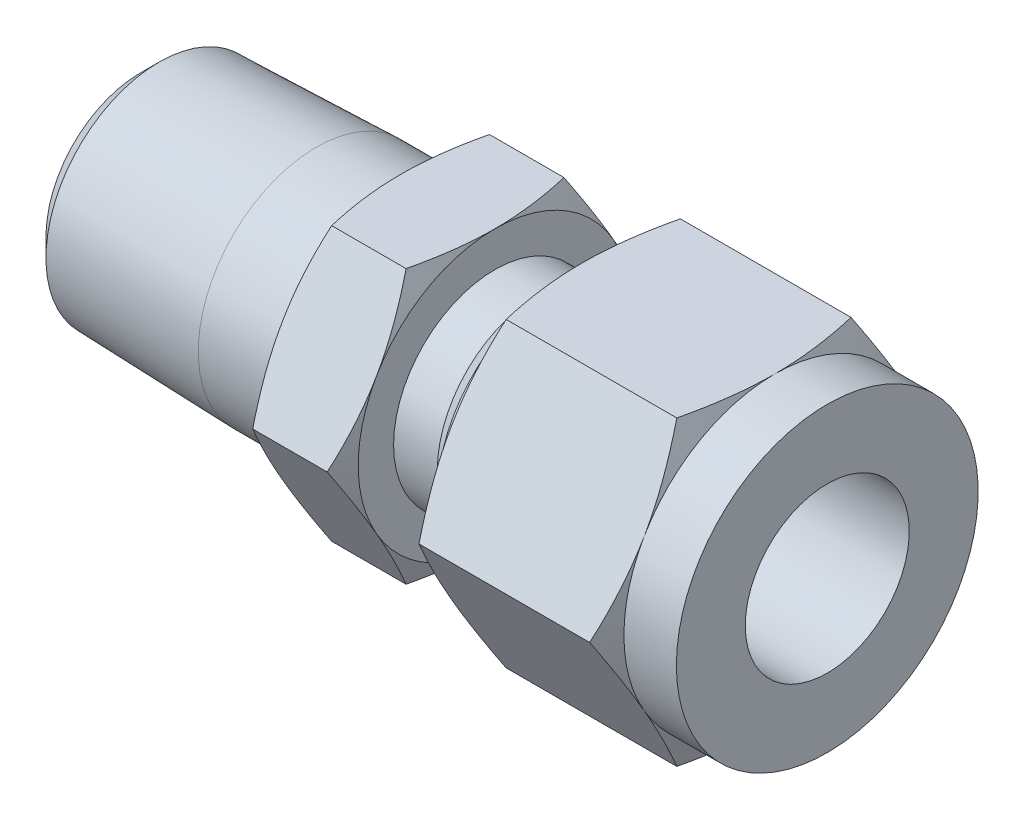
ISO-10303-21;
HEADER;
FILE_DESCRIPTION(('STEP AP214'),'2;1');
FILE_NAME('part.step','',(''),(''),'','','');
FILE_SCHEMA(('AUTOMOTIVE_DESIGN { 1 0 10303 214 1 1 1 1 }'));
ENDSEC;
DATA;
#1=APPLICATION_CONTEXT('core data for automotive mechanical design processes');
#2=APPLICATION_PROTOCOL_DEFINITION('international standard','automotive_design',2000,#1);
#3=PRODUCT_CONTEXT('',#1,'mechanical');
#4=PRODUCT('Part','Part','',(#3));
#5=PRODUCT_RELATED_PRODUCT_CATEGORY('part','',(#4));
#6=PRODUCT_DEFINITION_FORMATION('','',#4);
#7=PRODUCT_DEFINITION_CONTEXT('part definition',#1,'design');
#8=PRODUCT_DEFINITION('design','',#6,#7);
#9=PRODUCT_DEFINITION_SHAPE('','',#8);
#10=(LENGTH_UNIT() NAMED_UNIT(*) SI_UNIT(.MILLI.,.METRE.));
#11=(NAMED_UNIT(*) PLANE_ANGLE_UNIT() SI_UNIT($,.RADIAN.));
#12=(NAMED_UNIT(*) SI_UNIT($,.STERADIAN.) SOLID_ANGLE_UNIT());
#13=UNCERTAINTY_MEASURE_WITH_UNIT(LENGTH_MEASURE(1.E-05),#10,'distance_accuracy_value','');
#14=(GEOMETRIC_REPRESENTATION_CONTEXT(3) GLOBAL_UNCERTAINTY_ASSIGNED_CONTEXT((#13)) GLOBAL_UNIT_ASSIGNED_CONTEXT((#10,
#11,#12)) REPRESENTATION_CONTEXT('',''));
#15=CARTESIAN_POINT('',(0.,0.,0.));
#16=DIRECTION('',(0.,0.,1.));
#17=DIRECTION('',(1.,0.,0.));
#18=AXIS2_PLACEMENT_3D('',#15,#16,#17);
#19=CARTESIAN_POINT('',(21.844,0.,0.));
#20=DIRECTION('',(-1.,0.,0.));
#21=DIRECTION('',(0.,0.,1.));
#22=AXIS2_PLACEMENT_3D('',#19,#20,#21);
#23=CYLINDRICAL_SURFACE('',#22,5.88391);
#24=CARTESIAN_POINT('',(20.574,0.,0.));
#25=DIRECTION('',(-1.,0.,0.));
#26=DIRECTION('',(0.,0.,1.));
#27=AXIS2_PLACEMENT_3D('',#24,#25,#26);
#28=CIRCLE('',#27,5.88391);
#29=CARTESIAN_POINT('',(20.574,0.,5.88391));
#30=VERTEX_POINT('',#29);
#31=EDGE_CURVE('E19',#30,#30,#28,.T.);
#32=ORIENTED_EDGE('',*,*,#31,.F.);
#33=EDGE_LOOP('',(#32));
#34=FACE_BOUND('',#33,.T.);
#35=CARTESIAN_POINT('',(23.114000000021,0.,0.));
#36=DIRECTION('',(1.,0.,0.));
#37=DIRECTION('',(0.,0.,1.));
#38=AXIS2_PLACEMENT_3D('',#35,#36,#37);
#39=CIRCLE('',#38,5.88391000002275);
#40=CARTESIAN_POINT('',(23.114000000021,0.,5.88391000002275));
#41=VERTEX_POINT('',#40);
#42=EDGE_CURVE('E573',#41,#41,#39,.T.);
#43=ORIENTED_EDGE('',*,*,#42,.F.);
#44=EDGE_LOOP('',(#43));
#45=FACE_BOUND('',#44,.T.);
#46=ADVANCED_FACE('F16',(#34,#45),#23,.T.);
#47=CARTESIAN_POINT('',(24.3738399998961,0.,0.));
#48=DIRECTION('',(1.,0.,0.));
#49=DIRECTION('',(0.,1.,0.));
#50=AXIS2_PLACEMENT_3D('',#47,#48,#49);
#51=CONICAL_SURFACE('',#50,7.14374999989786,0.785398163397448);
#52=ORIENTED_EDGE('',*,*,#42,.T.);
#53=EDGE_LOOP('',(#52));
#54=FACE_BOUND('',#53,.T.);
#55=CARTESIAN_POINT('',(24.37384,0.,0.));
#56=DIRECTION('',(-1.,0.,0.));
#57=DIRECTION('',(0.,0.,1.));
#58=AXIS2_PLACEMENT_3D('',#55,#56,#57);
#59=CIRCLE('',#58,7.14375);
#60=CARTESIAN_POINT('',(24.37384,0.,7.14375));
#61=VERTEX_POINT('',#60);
#62=EDGE_CURVE('E203',#61,#61,#59,.F.);
#63=ORIENTED_EDGE('',*,*,#62,.F.);
#64=EDGE_LOOP('',(#63));
#65=FACE_BOUND('',#64,.T.);
#66=ADVANCED_FACE('F1044',(#54,#65),#51,.T.);
#67=CARTESIAN_POINT('',(20.574,0.,0.));
#68=DIRECTION('',(1.,0.,0.));
#69=DIRECTION('',(0.,1.,0.));
#70=AXIS2_PLACEMENT_3D('',#67,#68,#69);
#71=PLANE('',#70);
#72=ORIENTED_EDGE('',*,*,#31,.T.);
#73=EDGE_LOOP('',(#72));
#74=FACE_BOUND('',#73,.T.);
#75=CARTESIAN_POINT('',(20.574,0.,0.));
#76=DIRECTION('',(-1.,0.,0.));
#77=DIRECTION('',(0.,0.,1.));
#78=AXIS2_PLACEMENT_3D('',#75,#76,#77);
#79=CIRCLE('',#78,7.9375);
#80=CARTESIAN_POINT('',(20.574,3.96875,6.87407664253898));
#81=VERTEX_POINT('',#80);
#82=CARTESIAN_POINT('',(20.574,-3.96875,6.87407664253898));
#83=VERTEX_POINT('',#82);
#84=EDGE_CURVE('E1336',#81,#83,#79,.F.);
#85=ORIENTED_EDGE('',*,*,#84,.T.);
#86=CARTESIAN_POINT('',(20.574,0.,0.));
#87=DIRECTION('',(-1.,0.,0.));
#88=DIRECTION('',(0.,0.,1.));
#89=AXIS2_PLACEMENT_3D('',#86,#87,#88);
#90=CIRCLE('',#89,7.9375);
#91=CARTESIAN_POINT('',(20.574,-7.9375,0.));
#92=VERTEX_POINT('',#91);
#93=EDGE_CURVE('E201',#83,#92,#90,.F.);
#94=ORIENTED_EDGE('',*,*,#93,.T.);
#95=CARTESIAN_POINT('',(20.574,0.,0.));
#96=DIRECTION('',(-1.,0.,0.));
#97=DIRECTION('',(0.,0.,1.));
#98=AXIS2_PLACEMENT_3D('',#95,#96,#97);
#99=CIRCLE('',#98,7.9375);
#100=CARTESIAN_POINT('',(20.574,-3.96875,-6.87407664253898));
#101=VERTEX_POINT('',#100);
#102=EDGE_CURVE('E174',#92,#101,#99,.F.);
#103=ORIENTED_EDGE('',*,*,#102,.T.);
#104=CARTESIAN_POINT('',(20.574,0.,0.));
#105=DIRECTION('',(-1.,0.,0.));
#106=DIRECTION('',(0.,0.,1.));
#107=AXIS2_PLACEMENT_3D('',#104,#105,#106);
#108=CIRCLE('',#107,7.9375);
#109=CARTESIAN_POINT('',(20.574,3.96875,-6.87407664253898));
#110=VERTEX_POINT('',#109);
#111=EDGE_CURVE('E181',#101,#110,#108,.F.);
#112=ORIENTED_EDGE('',*,*,#111,.T.);
#113=CARTESIAN_POINT('',(20.574,0.,0.));
#114=DIRECTION('',(-1.,0.,0.));
#115=DIRECTION('',(0.,0.,1.));
#116=AXIS2_PLACEMENT_3D('',#113,#114,#115);
#117=CIRCLE('',#116,7.9375);
#118=CARTESIAN_POINT('',(20.574,7.9375,0.));
#119=VERTEX_POINT('',#118);
#120=EDGE_CURVE('E189',#110,#119,#117,.F.);
#121=ORIENTED_EDGE('',*,*,#120,.T.);
#122=CARTESIAN_POINT('',(20.574,0.,0.));
#123=DIRECTION('',(-1.,0.,0.));
#124=DIRECTION('',(0.,0.,1.));
#125=AXIS2_PLACEMENT_3D('',#122,#123,#124);
#126=CIRCLE('',#125,7.9375);
#127=EDGE_CURVE('E1339',#119,#81,#126,.F.);
#128=ORIENTED_EDGE('',*,*,#127,.T.);
#129=EDGE_LOOP('',(#85,#94,#103,#112,#121,#128));
#130=FACE_BOUND('',#129,.T.);
#131=ADVANCED_FACE('F200',(#74,#130),#71,.T.);
#132=CARTESIAN_POINT('',(25.01392,0.,0.));
#133=DIRECTION('',(-1.,0.,0.));
#134=DIRECTION('',(0.,0.,1.));
#135=AXIS2_PLACEMENT_3D('',#132,#133,#134);
#136=CYLINDRICAL_SURFACE('',#135,7.14375);
#137=ORIENTED_EDGE('',*,*,#62,.T.);
#138=EDGE_LOOP('',(#137));
#139=FACE_BOUND('',#138,.T.);
#140=CARTESIAN_POINT('',(25.654,0.,0.));
#141=DIRECTION('',(-1.,0.,0.));
#142=DIRECTION('',(0.,0.,1.));
#143=AXIS2_PLACEMENT_3D('',#140,#141,#142);
#144=CIRCLE('',#143,7.14375);
#145=CARTESIAN_POINT('',(25.654,0.,7.14375));
#146=VERTEX_POINT('',#145);
#147=EDGE_CURVE('E1335',#146,#146,#144,.F.);
#148=ORIENTED_EDGE('',*,*,#147,.F.);
#149=EDGE_LOOP('',(#148));
#150=FACE_BOUND('',#149,.T.);
#151=ADVANCED_FACE('F768',(#139,#150),#136,.T.);
#152=CARTESIAN_POINT('',(20.574,0.,0.));
#153=DIRECTION('',(-1.,0.,0.));
#154=DIRECTION('',(0.,0.,1.));
#155=AXIS2_PLACEMENT_3D('',#152,#153,#154);
#156=CONICAL_SURFACE('',#155,7.9375,1.13446401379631);
#157=ORIENTED_EDGE('',*,*,#102,.F.);
#158=CARTESIAN_POINT('',(20.0014042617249,-7.9375,-4.58271776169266));
#159=CARTESIAN_POINT('',(20.0891005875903,-7.9375,-4.2067240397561));
#160=CARTESIAN_POINT('',(20.1691332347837,-7.9375,-3.82870450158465));
#161=CARTESIAN_POINT('',(20.3100133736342,-7.9375,-3.07045114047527));
#162=CARTESIAN_POINT('',(20.370924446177,-7.9375,-2.69022903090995));
#163=CARTESIAN_POINT('',(20.4455083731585,-7.9375,-2.11754956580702));
#164=CARTESIAN_POINT('',(20.4675783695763,-7.9375,-1.92618361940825));
#165=CARTESIAN_POINT('',(20.5057377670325,-7.9375,-1.54285438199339));
#166=CARTESIAN_POINT('',(20.5218272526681,-7.9375,-1.35089109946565));
#167=CARTESIAN_POINT('',(20.5477563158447,-7.9375,-0.965896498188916));
#168=CARTESIAN_POINT('',(20.5575748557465,-7.9375,-0.77286375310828));
#169=CARTESIAN_POINT('',(20.570708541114,-7.9375,-0.386555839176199));
#170=CARTESIAN_POINT('',(20.5740229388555,-7.9375,-0.19328064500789));
#171=CARTESIAN_POINT('',(20.574,-7.93749999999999,0.));
#172=B_SPLINE_CURVE_WITH_KNOTS('',3,(#158,#159,#160,#161,#162,#163,#164,#165,#166,#167,#168,
#169,#170,#171),.UNSPECIFIED.,.F.,.F.,(4,2,2,2,2,2,4),(0.,1.1585482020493,2.31320229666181,
2.89102016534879,3.46882986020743,4.048567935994,4.62837265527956),.UNSPECIFIED.);
#173=CARTESIAN_POINT('',(20.0014042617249,-7.9375,-4.58271776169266));
#174=VERTEX_POINT('',#173);
#175=EDGE_CURVE('E205',#174,#92,#172,.T.);
#176=ORIENTED_EDGE('',*,*,#175,.F.);
#177=CARTESIAN_POINT('',(20.574,-3.96875,-6.87407664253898));
#178=CARTESIAN_POINT('',(20.5740229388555,-4.13613594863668,-6.77743632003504));
#179=CARTESIAN_POINT('',(20.570708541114,-4.3035171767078,-6.68079872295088));
#180=CARTESIAN_POINT('',(20.5575748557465,-4.63806964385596,-6.48764476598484));
#181=CARTESIAN_POINT('',(20.5477563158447,-4.80524090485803,-6.39112839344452));
#182=CARTESIAN_POINT('',(20.5218272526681,-5.13865600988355,-6.19863109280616));
#183=CARTESIAN_POINT('',(20.5057377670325,-5.30490108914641,-6.10264945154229));
#184=CARTESIAN_POINT('',(20.4675783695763,-5.636873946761,-5.91098483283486));
#185=CARTESIAN_POINT('',(20.4455083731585,-5.80260171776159,-5.81530185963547));
#186=CARTESIAN_POINT('',(20.370924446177,-6.2985566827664,-5.52896212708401));
#187=CARTESIAN_POINT('',(20.3100133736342,-6.62783868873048,-5.33885107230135));
#188=CARTESIAN_POINT('',(20.1691332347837,-7.28450536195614,-4.95972439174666));
#189=CARTESIAN_POINT('',(20.0891005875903,-7.61187988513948,-4.77071462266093));
#190=CARTESIAN_POINT('',(20.0014042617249,-7.9375,-4.58271776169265));
#191=B_SPLINE_CURVE_WITH_KNOTS('',3,(#177,#178,#179,#180,#181,#182,#183,#184,#185,#186,#187,
#188,#189,#190),.UNSPECIFIED.,.F.,.F.,(4,2,2,2,2,2,4),(0.,0.57980471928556,1.15954279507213,
1.73735248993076,2.31517035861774,3.46982445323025,4.62837265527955),.UNSPECIFIED.);
#192=EDGE_CURVE('E194',#101,#174,#191,.T.);
#193=ORIENTED_EDGE('',*,*,#192,.F.);
#194=EDGE_LOOP('',(#157,#176,#193));
#195=FACE_BOUND('',#194,.T.);
#196=ADVANCED_FACE('F204',(#195),#156,.T.);
#197=CARTESIAN_POINT('',(20.574,0.,0.));
#198=DIRECTION('',(-1.,0.,0.));
#199=DIRECTION('',(0.,0.,1.));
#200=AXIS2_PLACEMENT_3D('',#197,#198,#199);
#201=CONICAL_SURFACE('',#200,7.9375,1.13446401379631);
#202=ORIENTED_EDGE('',*,*,#111,.F.);
#203=CARTESIAN_POINT('',(20.0014042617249,0.,-9.16543552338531));
#204=CARTESIAN_POINT('',(20.0891005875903,-0.325620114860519,-8.97743866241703));
#205=CARTESIAN_POINT('',(20.1691332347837,-0.652994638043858,-8.78842889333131));
#206=CARTESIAN_POINT('',(20.3100133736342,-1.30966131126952,-8.40930221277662));
#207=CARTESIAN_POINT('',(20.370924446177,-1.6389433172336,-8.21919115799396));
#208=CARTESIAN_POINT('',(20.4455083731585,-2.13489828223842,-7.93285142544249));
#209=CARTESIAN_POINT('',(20.4675783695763,-2.30062605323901,-7.83716845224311));
#210=CARTESIAN_POINT('',(20.5057377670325,-2.63259891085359,-7.64550383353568));
#211=CARTESIAN_POINT('',(20.5218272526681,-2.79884399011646,-7.54952219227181));
#212=CARTESIAN_POINT('',(20.5477563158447,-3.13225909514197,-7.35702489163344));
#213=CARTESIAN_POINT('',(20.5575748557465,-3.29943035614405,-7.26050851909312));
#214=CARTESIAN_POINT('',(20.570708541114,-3.6339828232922,-7.06735456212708));
#215=CARTESIAN_POINT('',(20.5740229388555,-3.80136405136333,-6.97071696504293));
#216=CARTESIAN_POINT('',(20.574,-3.96875,-6.87407664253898));
#217=B_SPLINE_CURVE_WITH_KNOTS('',3,(#203,#204,#205,#206,#207,#208,#209,#210,#211,#212,#213,
#214,#215,#216),.UNSPECIFIED.,.F.,.F.,(4,2,2,2,2,2,4),(0.,1.1585482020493,2.31320229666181,
2.89102016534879,3.46882986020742,4.04856793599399,4.62837265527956),.UNSPECIFIED.);
#218=CARTESIAN_POINT('',(20.0014042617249,0.,-9.16543552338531));
#219=VERTEX_POINT('',#218);
#220=EDGE_CURVE('E184',#219,#101,#217,.T.);
#221=ORIENTED_EDGE('',*,*,#220,.F.);
#222=CARTESIAN_POINT('',(20.574,3.96875,-6.87407664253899));
#223=CARTESIAN_POINT('',(20.5740229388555,3.80136405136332,-6.97071696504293));
#224=CARTESIAN_POINT('',(20.570708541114,3.6339828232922,-7.06735456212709));
#225=CARTESIAN_POINT('',(20.5575748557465,3.29943035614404,-7.26050851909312));
#226=CARTESIAN_POINT('',(20.5477563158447,3.13225909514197,-7.35702489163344));
#227=CARTESIAN_POINT('',(20.5218272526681,2.79884399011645,-7.54952219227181));
#228=CARTESIAN_POINT('',(20.5057377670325,2.63259891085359,-7.64550383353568));
#229=CARTESIAN_POINT('',(20.4675783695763,2.300626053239,-7.83716845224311));
#230=CARTESIAN_POINT('',(20.4455083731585,2.13489828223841,-7.93285142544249));
#231=CARTESIAN_POINT('',(20.370924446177,1.6389433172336,-8.21919115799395));
#232=CARTESIAN_POINT('',(20.3100133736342,1.30966131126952,-8.40930221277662));
#233=CARTESIAN_POINT('',(20.1691332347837,0.652994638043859,-8.78842889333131));
#234=CARTESIAN_POINT('',(20.0891005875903,0.325620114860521,-8.97743866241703));
#235=CARTESIAN_POINT('',(20.0014042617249,0.,-9.16543552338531));
#236=B_SPLINE_CURVE_WITH_KNOTS('',3,(#222,#223,#224,#225,#226,#227,#228,#229,#230,#231,#232,
#233,#234,#235),.UNSPECIFIED.,.F.,.F.,(4,2,2,2,2,2,4),(0.,0.579804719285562,1.15954279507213,
1.73735248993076,2.31517035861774,3.46982445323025,4.62837265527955),.UNSPECIFIED.);
#237=EDGE_CURVE('E186',#110,#219,#236,.T.);
#238=ORIENTED_EDGE('',*,*,#237,.F.);
#239=EDGE_LOOP('',(#202,#221,#238));
#240=FACE_BOUND('',#239,.T.);
#241=ADVANCED_FACE('F183',(#240),#201,.T.);
#242=CARTESIAN_POINT('',(20.574,0.,0.));
#243=DIRECTION('',(-1.,0.,0.));
#244=DIRECTION('',(0.,0.,1.));
#245=AXIS2_PLACEMENT_3D('',#242,#243,#244);
#246=CONICAL_SURFACE('',#245,7.9375,1.13446401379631);
#247=CARTESIAN_POINT('',(20.574,7.9375,0.));
#248=CARTESIAN_POINT('',(20.5740229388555,7.9375,-0.19328064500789));
#249=CARTESIAN_POINT('',(20.570708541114,7.9375,-0.3865558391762));
#250=CARTESIAN_POINT('',(20.5575748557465,7.9375,-0.77286375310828));
#251=CARTESIAN_POINT('',(20.5477563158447,7.9375,-0.965896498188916));
#252=CARTESIAN_POINT('',(20.5218272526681,7.9375,-1.35089109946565));
#253=CARTESIAN_POINT('',(20.5057377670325,7.9375,-1.54285438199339));
#254=CARTESIAN_POINT('',(20.4675783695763,7.9375,-1.92618361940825));
#255=CARTESIAN_POINT('',(20.4455083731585,7.9375,-2.11754956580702));
#256=CARTESIAN_POINT('',(20.370924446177,7.9375,-2.69022903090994));
#257=CARTESIAN_POINT('',(20.3100133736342,7.9375,-3.07045114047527));
#258=CARTESIAN_POINT('',(20.1691332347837,7.9375,-3.82870450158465));
#259=CARTESIAN_POINT('',(20.0891005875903,7.9375,-4.2067240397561));
#260=CARTESIAN_POINT('',(20.0014042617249,7.9375,-4.58271776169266));
#261=B_SPLINE_CURVE_WITH_KNOTS('',3,(#247,#248,#249,#250,#251,#252,#253,#254,#255,#256,#257,
#258,#259,#260),.UNSPECIFIED.,.F.,.F.,(4,2,2,2,2,2,4),(0.,0.579804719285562,1.15954279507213,
1.73735248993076,2.31517035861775,3.46982445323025,4.62837265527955),.UNSPECIFIED.);
#262=CARTESIAN_POINT('',(20.0014042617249,7.9375,-4.58271776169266));
#263=VERTEX_POINT('',#262);
#264=EDGE_CURVE('E569',#119,#263,#261,.T.);
#265=ORIENTED_EDGE('',*,*,#264,.F.);
#266=ORIENTED_EDGE('',*,*,#120,.F.);
#267=CARTESIAN_POINT('',(20.0014042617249,7.9375,-4.58271776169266));
#268=CARTESIAN_POINT('',(20.0891005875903,7.61187988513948,-4.77071462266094));
#269=CARTESIAN_POINT('',(20.1691332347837,7.28450536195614,-4.95972439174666));
#270=CARTESIAN_POINT('',(20.3100133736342,6.62783868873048,-5.33885107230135));
#271=CARTESIAN_POINT('',(20.370924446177,6.2985566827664,-5.52896212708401));
#272=CARTESIAN_POINT('',(20.4455083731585,5.80260171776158,-5.81530185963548));
#273=CARTESIAN_POINT('',(20.4675783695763,5.636873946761,-5.91098483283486));
#274=CARTESIAN_POINT('',(20.5057377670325,5.30490108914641,-6.10264945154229));
#275=CARTESIAN_POINT('',(20.5218272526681,5.13865600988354,-6.19863109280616));
#276=CARTESIAN_POINT('',(20.5477563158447,4.80524090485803,-6.39112839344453));
#277=CARTESIAN_POINT('',(20.5575748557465,4.63806964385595,-6.48764476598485));
#278=CARTESIAN_POINT('',(20.570708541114,4.3035171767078,-6.68079872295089));
#279=CARTESIAN_POINT('',(20.5740229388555,4.13613594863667,-6.77743632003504));
#280=CARTESIAN_POINT('',(20.574,3.96875,-6.87407664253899));
#281=B_SPLINE_CURVE_WITH_KNOTS('',3,(#267,#268,#269,#270,#271,#272,#273,#274,#275,#276,#277,
#278,#279,#280),.UNSPECIFIED.,.F.,.F.,(4,2,2,2,2,2,4),(0.,1.1585482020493,2.31320229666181,
2.89102016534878,3.46882986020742,4.04856793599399,4.62837265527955),.UNSPECIFIED.);
#282=EDGE_CURVE('E209',#263,#110,#281,.T.);
#283=ORIENTED_EDGE('',*,*,#282,.F.);
#284=EDGE_LOOP('',(#265,#266,#283));
#285=FACE_BOUND('',#284,.T.);
#286=ADVANCED_FACE('F754',(#285),#246,.T.);
#287=CARTESIAN_POINT('',(20.574,0.,0.));
#288=DIRECTION('',(-1.,0.,0.));
#289=DIRECTION('',(0.,0.,1.));
#290=AXIS2_PLACEMENT_3D('',#287,#288,#289);
#291=CONICAL_SURFACE('',#290,7.9375,1.13446401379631);
#292=CARTESIAN_POINT('',(20.574,-7.93749999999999,0.));
#293=CARTESIAN_POINT('',(20.5740229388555,-7.93749999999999,0.193280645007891));
#294=CARTESIAN_POINT('',(20.570708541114,-7.93749999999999,0.3865558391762));
#295=CARTESIAN_POINT('',(20.5575748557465,-7.93749999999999,0.772863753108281));
#296=CARTESIAN_POINT('',(20.5477563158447,-7.93749999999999,0.965896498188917));
#297=CARTESIAN_POINT('',(20.5218272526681,-7.93749999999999,1.35089109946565));
#298=CARTESIAN_POINT('',(20.5057377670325,-7.93749999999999,1.54285438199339));
#299=CARTESIAN_POINT('',(20.4675783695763,-7.93749999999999,1.92618361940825));
#300=CARTESIAN_POINT('',(20.4455083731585,-7.93749999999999,2.11754956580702));
#301=CARTESIAN_POINT('',(20.370924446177,-7.93749999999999,2.69022903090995));
#302=CARTESIAN_POINT('',(20.3100133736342,-7.93749999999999,3.07045114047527));
#303=CARTESIAN_POINT('',(20.1691332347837,-7.93749999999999,3.82870450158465));
#304=CARTESIAN_POINT('',(20.0891005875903,-7.93749999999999,4.2067240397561));
#305=CARTESIAN_POINT('',(20.0014042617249,-7.93749999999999,4.58271776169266));
#306=B_SPLINE_CURVE_WITH_KNOTS('',3,(#292,#293,#294,#295,#296,#297,#298,#299,#300,#301,#302,
#303,#304,#305),.UNSPECIFIED.,.F.,.F.,(4,2,2,2,2,2,4),(0.,0.579804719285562,1.15954279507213,
1.73735248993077,2.31517035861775,3.46982445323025,4.62837265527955),.UNSPECIFIED.);
#307=CARTESIAN_POINT('',(20.0014042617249,-7.93749999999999,4.58271776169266));
#308=VERTEX_POINT('',#307);
#309=EDGE_CURVE('E196',#92,#308,#306,.T.);
#310=ORIENTED_EDGE('',*,*,#309,.F.);
#311=ORIENTED_EDGE('',*,*,#93,.F.);
#312=CARTESIAN_POINT('',(20.0014042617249,-7.93749999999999,4.58271776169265));
#313=CARTESIAN_POINT('',(20.0891005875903,-7.61187988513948,4.77071462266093));
#314=CARTESIAN_POINT('',(20.1691332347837,-7.28450536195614,4.95972439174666));
#315=CARTESIAN_POINT('',(20.3100133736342,-6.62783868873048,5.33885107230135));
#316=CARTESIAN_POINT('',(20.370924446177,-6.2985566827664,5.52896212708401));
#317=CARTESIAN_POINT('',(20.4455083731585,-5.80260171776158,5.81530185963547));
#318=CARTESIAN_POINT('',(20.4675783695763,-5.63687394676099,5.91098483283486));
#319=CARTESIAN_POINT('',(20.5057377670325,-5.30490108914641,6.10264945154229));
#320=CARTESIAN_POINT('',(20.5218272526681,-5.13865600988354,6.19863109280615));
#321=CARTESIAN_POINT('',(20.5477563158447,-4.80524090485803,6.39112839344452));
#322=CARTESIAN_POINT('',(20.5575748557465,-4.63806964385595,6.48764476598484));
#323=CARTESIAN_POINT('',(20.570708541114,-4.3035171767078,6.68079872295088));
#324=CARTESIAN_POINT('',(20.5740229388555,-4.13613594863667,6.77743632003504));
#325=CARTESIAN_POINT('',(20.574,-3.96875,6.87407664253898));
#326=B_SPLINE_CURVE_WITH_KNOTS('',3,(#312,#313,#314,#315,#316,#317,#318,#319,#320,#321,#322,
#323,#324,#325),.UNSPECIFIED.,.F.,.F.,(4,2,2,2,2,2,4),(0.,1.1585482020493,2.31320229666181,
2.89102016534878,3.46882986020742,4.04856793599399,4.62837265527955),.UNSPECIFIED.);
#327=EDGE_CURVE('E312',#308,#83,#326,.T.);
#328=ORIENTED_EDGE('',*,*,#327,.F.);
#329=EDGE_LOOP('',(#310,#311,#328));
#330=FACE_BOUND('',#329,.T.);
#331=ADVANCED_FACE('F757',(#330),#291,.T.);
#332=CARTESIAN_POINT('',(20.574,0.,0.));
#333=DIRECTION('',(-1.,0.,0.));
#334=DIRECTION('',(0.,0.,1.));
#335=AXIS2_PLACEMENT_3D('',#332,#333,#334);
#336=CONICAL_SURFACE('',#335,7.9375,1.13446401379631);
#337=CARTESIAN_POINT('',(20.574,3.96875,6.87407664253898));
#338=CARTESIAN_POINT('',(20.5740229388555,4.13613594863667,6.77743632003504));
#339=CARTESIAN_POINT('',(20.570708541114,4.3035171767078,6.68079872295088));
#340=CARTESIAN_POINT('',(20.5575748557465,4.63806964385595,6.48764476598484));
#341=CARTESIAN_POINT('',(20.5477563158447,4.80524090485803,6.39112839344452));
#342=CARTESIAN_POINT('',(20.5218272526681,5.13865600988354,6.19863109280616));
#343=CARTESIAN_POINT('',(20.5057377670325,5.30490108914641,6.10264945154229));
#344=CARTESIAN_POINT('',(20.4675783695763,5.636873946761,5.91098483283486));
#345=CARTESIAN_POINT('',(20.4455083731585,5.80260171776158,5.81530185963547));
#346=CARTESIAN_POINT('',(20.370924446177,6.2985566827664,5.52896212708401));
#347=CARTESIAN_POINT('',(20.3100133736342,6.62783868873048,5.33885107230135));
#348=CARTESIAN_POINT('',(20.1691332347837,7.28450536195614,4.95972439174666));
#349=CARTESIAN_POINT('',(20.0891005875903,7.61187988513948,4.77071462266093));
#350=CARTESIAN_POINT('',(20.0014042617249,7.9375,4.58271776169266));
#351=B_SPLINE_CURVE_WITH_KNOTS('',3,(#337,#338,#339,#340,#341,#342,#343,#344,#345,#346,#347,
#348,#349,#350),.UNSPECIFIED.,.F.,.F.,(4,2,2,2,2,2,4),(0.,0.579804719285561,1.15954279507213,
1.73735248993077,2.31517035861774,3.46982445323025,4.62837265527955),.UNSPECIFIED.);
#352=CARTESIAN_POINT('',(20.0014042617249,7.9375,4.58271776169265));
#353=VERTEX_POINT('',#352);
#354=EDGE_CURVE('E559',#81,#353,#351,.T.);
#355=ORIENTED_EDGE('',*,*,#354,.F.);
#356=ORIENTED_EDGE('',*,*,#127,.F.);
#357=CARTESIAN_POINT('',(20.0014042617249,7.9375,4.58271776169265));
#358=CARTESIAN_POINT('',(20.0891005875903,7.9375,4.2067240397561));
#359=CARTESIAN_POINT('',(20.1691332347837,7.9375,3.82870450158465));
#360=CARTESIAN_POINT('',(20.3100133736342,7.9375,3.07045114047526));
#361=CARTESIAN_POINT('',(20.370924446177,7.9375,2.69022903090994));
#362=CARTESIAN_POINT('',(20.4455083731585,7.9375,2.11754956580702));
#363=CARTESIAN_POINT('',(20.4675783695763,7.9375,1.92618361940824));
#364=CARTESIAN_POINT('',(20.5057377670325,7.9375,1.54285438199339));
#365=CARTESIAN_POINT('',(20.5218272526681,7.9375,1.35089109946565));
#366=CARTESIAN_POINT('',(20.5477563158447,7.9375,0.965896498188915));
#367=CARTESIAN_POINT('',(20.5575748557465,7.9375,0.772863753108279));
#368=CARTESIAN_POINT('',(20.570708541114,7.9375,0.386555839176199));
#369=CARTESIAN_POINT('',(20.5740229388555,7.9375,0.19328064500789));
#370=CARTESIAN_POINT('',(20.574,7.9375,0.));
#371=B_SPLINE_CURVE_WITH_KNOTS('',3,(#357,#358,#359,#360,#361,#362,#363,#364,#365,#366,#367,
#368,#369,#370),.UNSPECIFIED.,.F.,.F.,(4,2,2,2,2,2,4),(0.,1.1585482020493,2.3132022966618,
2.89102016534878,3.46882986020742,4.04856793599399,4.62837265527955),.UNSPECIFIED.);
#372=EDGE_CURVE('E568',#353,#119,#371,.T.);
#373=ORIENTED_EDGE('',*,*,#372,.F.);
#374=EDGE_LOOP('',(#355,#356,#373));
#375=FACE_BOUND('',#374,.T.);
#376=ADVANCED_FACE('F735',(#375),#336,.T.);
#377=CARTESIAN_POINT('',(20.574,0.,0.));
#378=DIRECTION('',(-1.,0.,0.));
#379=DIRECTION('',(0.,0.,1.));
#380=AXIS2_PLACEMENT_3D('',#377,#378,#379);
#381=CONICAL_SURFACE('',#380,7.9375,1.13446401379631);
#382=CARTESIAN_POINT('',(20.574,-3.96875,6.87407664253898));
#383=CARTESIAN_POINT('',(20.5740229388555,-3.80136405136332,6.97071696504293));
#384=CARTESIAN_POINT('',(20.570708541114,-3.6339828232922,7.06735456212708));
#385=CARTESIAN_POINT('',(20.5575748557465,-3.29943035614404,7.26050851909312));
#386=CARTESIAN_POINT('',(20.5477563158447,-3.13225909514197,7.35702489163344));
#387=CARTESIAN_POINT('',(20.5218272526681,-2.79884399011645,7.54952219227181));
#388=CARTESIAN_POINT('',(20.5057377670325,-2.63259891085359,7.64550383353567));
#389=CARTESIAN_POINT('',(20.4675783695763,-2.300626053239,7.8371684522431));
#390=CARTESIAN_POINT('',(20.4455083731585,-2.13489828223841,7.93285142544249));
#391=CARTESIAN_POINT('',(20.370924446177,-1.6389433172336,8.21919115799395));
#392=CARTESIAN_POINT('',(20.3100133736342,-1.30966131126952,8.40930221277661));
#393=CARTESIAN_POINT('',(20.1691332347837,-0.652994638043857,8.78842889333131));
#394=CARTESIAN_POINT('',(20.0891005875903,-0.325620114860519,8.97743866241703));
#395=CARTESIAN_POINT('',(20.0014042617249,0.,9.16543552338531));
#396=B_SPLINE_CURVE_WITH_KNOTS('',3,(#382,#383,#384,#385,#386,#387,#388,#389,#390,#391,#392,
#393,#394,#395),.UNSPECIFIED.,.F.,.F.,(4,2,2,2,2,2,4),(0.,0.579804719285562,1.15954279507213,
1.73735248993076,2.31517035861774,3.46982445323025,4.62837265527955),.UNSPECIFIED.);
#397=CARTESIAN_POINT('',(20.0014042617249,0.,9.16543552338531));
#398=VERTEX_POINT('',#397);
#399=EDGE_CURVE('E553',#83,#398,#396,.T.);
#400=ORIENTED_EDGE('',*,*,#399,.F.);
#401=ORIENTED_EDGE('',*,*,#84,.F.);
#402=CARTESIAN_POINT('',(20.0014042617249,0.,9.16543552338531));
#403=CARTESIAN_POINT('',(20.0891005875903,0.32562011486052,8.97743866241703));
#404=CARTESIAN_POINT('',(20.1691332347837,0.652994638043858,8.7884288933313));
#405=CARTESIAN_POINT('',(20.3100133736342,1.30966131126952,8.40930221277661));
#406=CARTESIAN_POINT('',(20.370924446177,1.6389433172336,8.21919115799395));
#407=CARTESIAN_POINT('',(20.4455083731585,2.13489828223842,7.93285142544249));
#408=CARTESIAN_POINT('',(20.4675783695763,2.300626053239,7.8371684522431));
#409=CARTESIAN_POINT('',(20.5057377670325,2.63259891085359,7.64550383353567));
#410=CARTESIAN_POINT('',(20.5218272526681,2.79884399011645,7.54952219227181));
#411=CARTESIAN_POINT('',(20.5477563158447,3.13225909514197,7.35702489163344));
#412=CARTESIAN_POINT('',(20.5575748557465,3.29943035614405,7.26050851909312));
#413=CARTESIAN_POINT('',(20.570708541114,3.6339828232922,7.06735456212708));
#414=CARTESIAN_POINT('',(20.5740229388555,3.80136405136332,6.97071696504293));
#415=CARTESIAN_POINT('',(20.574,3.96875,6.87407664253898));
#416=B_SPLINE_CURVE_WITH_KNOTS('',3,(#402,#403,#404,#405,#406,#407,#408,#409,#410,#411,#412,
#413,#414,#415),.UNSPECIFIED.,.F.,.F.,(4,2,2,2,2,2,4),(0.,1.1585482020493,2.31320229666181,
2.89102016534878,3.46882986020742,4.04856793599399,4.62837265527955),.UNSPECIFIED.);
#417=EDGE_CURVE('E554',#398,#81,#416,.T.);
#418=ORIENTED_EDGE('',*,*,#417,.F.);
#419=EDGE_LOOP('',(#400,#401,#418));
#420=FACE_BOUND('',#419,.T.);
#421=ADVANCED_FACE('F731',(#420),#381,.T.);
#422=CARTESIAN_POINT('',(25.654,0.,7.953375));
#423=DIRECTION('',(-1.,0.,0.));
#424=DIRECTION('',(0.,0.,1.));
#425=AXIS2_PLACEMENT_3D('',#422,#423,#424);
#426=PLANE('',#425);
#427=ORIENTED_EDGE('',*,*,#147,.T.);
#428=EDGE_LOOP('',(#427));
#429=FACE_BOUND('',#428,.T.);
#430=CARTESIAN_POINT('',(25.654,0.,0.));
#431=DIRECTION('',(1.,0.,0.));
#432=DIRECTION('',(0.,1.,0.));
#433=AXIS2_PLACEMENT_3D('',#430,#431,#432);
#434=CIRCLE('',#433,8.763);
#435=CARTESIAN_POINT('',(25.654,-4.3815,-7.58898061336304));
#436=VERTEX_POINT('',#435);
#437=CARTESIAN_POINT('',(25.654,-8.763,0.));
#438=VERTEX_POINT('',#437);
#439=EDGE_CURVE('E716',#436,#438,#434,.F.);
#440=ORIENTED_EDGE('',*,*,#439,.T.);
#441=CARTESIAN_POINT('',(25.654,0.,0.));
#442=DIRECTION('',(1.,0.,0.));
#443=DIRECTION('',(0.,1.,0.));
#444=AXIS2_PLACEMENT_3D('',#441,#442,#443);
#445=CIRCLE('',#444,8.763);
#446=CARTESIAN_POINT('',(25.654,-4.3815,7.58898061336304));
#447=VERTEX_POINT('',#446);
#448=EDGE_CURVE('E713',#438,#447,#445,.F.);
#449=ORIENTED_EDGE('',*,*,#448,.T.);
#450=CARTESIAN_POINT('',(25.654,0.,0.));
#451=DIRECTION('',(1.,0.,0.));
#452=DIRECTION('',(0.,1.,0.));
#453=AXIS2_PLACEMENT_3D('',#450,#451,#452);
#454=CIRCLE('',#453,8.763);
#455=CARTESIAN_POINT('',(25.654,4.3815,7.58898061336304));
#456=VERTEX_POINT('',#455);
#457=EDGE_CURVE('E717',#447,#456,#454,.F.);
#458=ORIENTED_EDGE('',*,*,#457,.T.);
#459=CARTESIAN_POINT('',(25.654,0.,0.));
#460=DIRECTION('',(1.,0.,0.));
#461=DIRECTION('',(0.,1.,0.));
#462=AXIS2_PLACEMENT_3D('',#459,#460,#461);
#463=CIRCLE('',#462,8.763);
#464=CARTESIAN_POINT('',(25.654,8.763,0.));
#465=VERTEX_POINT('',#464);
#466=EDGE_CURVE('E557',#456,#465,#463,.F.);
#467=ORIENTED_EDGE('',*,*,#466,.T.);
#468=CARTESIAN_POINT('',(25.654,0.,0.));
#469=DIRECTION('',(1.,0.,0.));
#470=DIRECTION('',(0.,0.,-1.));
#471=AXIS2_PLACEMENT_3D('',#468,#469,#470);
#472=CIRCLE('',#471,8.763);
#473=CARTESIAN_POINT('',(25.654,4.38149999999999,-7.58898061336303));
#474=VERTEX_POINT('',#473);
#475=EDGE_CURVE('E297',#465,#474,#472,.F.);
#476=ORIENTED_EDGE('',*,*,#475,.T.);
#477=CARTESIAN_POINT('',(25.654,0.,0.));
#478=DIRECTION('',(1.,0.,0.));
#479=DIRECTION('',(0.,0.,-1.));
#480=AXIS2_PLACEMENT_3D('',#477,#478,#479);
#481=CIRCLE('',#480,8.76299999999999);
#482=EDGE_CURVE('E719',#474,#436,#481,.F.);
#483=ORIENTED_EDGE('',*,*,#482,.T.);
#484=EDGE_LOOP('',(#440,#449,#458,#467,#476,#483));
#485=FACE_BOUND('',#484,.T.);
#486=ADVANCED_FACE('F734',(#429,#485),#426,.T.);
#487=CARTESIAN_POINT('',(15.10284,-7.9375,-4.58271776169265));
#488=DIRECTION('',(0.,-1.,0.));
#489=DIRECTION('',(0.,0.,-1.));
#490=AXIS2_PLACEMENT_3D('',#487,#488,#489);
#491=PLANE('',#490);
#492=CARTESIAN_POINT('',(15.10284,-7.93749999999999,0.));
#493=CARTESIAN_POINT('',(15.1028170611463,-7.9375,-0.193280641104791));
#494=CARTESIAN_POINT('',(15.1061314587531,-7.9375,-0.386555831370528));
#495=CARTESIAN_POINT('',(15.1192651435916,-7.9375,-0.772863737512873));
#496=CARTESIAN_POINT('',(15.1290836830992,-7.9375,-0.965896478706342));
#497=CARTESIAN_POINT('',(15.1550127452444,-7.9375,-1.35089107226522));
#498=CARTESIAN_POINT('',(15.1711022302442,-7.9375,-1.54285435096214));
#499=CARTESIAN_POINT('',(15.2092616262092,-7.9375,-1.92618358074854));
#500=CARTESIAN_POINT('',(15.2313316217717,-7.9375,-2.11754952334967));
#501=CARTESIAN_POINT('',(15.3059155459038,-7.9375,-2.69022897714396));
#502=CARTESIAN_POINT('',(15.366826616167,-7.9375,-3.07045107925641));
#503=CARTESIAN_POINT('',(15.5077067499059,-7.9375,-3.82870442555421));
#504=CARTESIAN_POINT('',(15.5877393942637,-7.9375,-4.20672395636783));
#505=CARTESIAN_POINT('',(15.6754357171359,-7.9375,-4.58271767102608));
#506=B_SPLINE_CURVE_WITH_KNOTS('',3,(#492,#493,#494,#495,#496,#497,#498,#499,#500,#501,#502,
#503,#504,#505),.UNSPECIFIED.,.F.,.F.,(4,2,2,2,2,2,4),(0.,0.579804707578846,1.15954277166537,
1.73735245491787,2.31517031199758,3.46982438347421,4.62837256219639),.UNSPECIFIED.);
#507=CARTESIAN_POINT('',(15.10284,-7.9375,0.));
#508=VERTEX_POINT('',#507);
#509=CARTESIAN_POINT('',(15.6754357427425,-7.93750001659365,-4.5827177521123));
#510=VERTEX_POINT('',#509);
#511=EDGE_CURVE('E259',#508,#510,#506,.T.);
#512=ORIENTED_EDGE('',*,*,#511,.T.);
#513=DIRECTION('',(1.,0.,0.));
#514=VECTOR('',#513,1.);
#515=CARTESIAN_POINT('',(15.10284,-7.9375,-4.58271776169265));
#516=LINE('',#515,#514);
#517=EDGE_CURVE('E207',#174,#510,#516,.F.);
#518=ORIENTED_EDGE('',*,*,#517,.F.);
#519=ORIENTED_EDGE('',*,*,#175,.T.);
#520=ORIENTED_EDGE('',*,*,#309,.T.);
#521=DIRECTION('',(1.,0.,0.));
#522=VECTOR('',#521,1.);
#523=CARTESIAN_POINT('',(15.10284,-7.93749999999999,4.58271776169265));
#524=LINE('',#523,#522);
#525=CARTESIAN_POINT('',(15.6754357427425,-7.93749999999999,4.58271778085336));
#526=VERTEX_POINT('',#525);
#527=EDGE_CURVE('E564',#526,#308,#524,.T.);
#528=ORIENTED_EDGE('',*,*,#527,.F.);
#529=CARTESIAN_POINT('',(15.6754357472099,-7.93749999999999,4.58271780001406));
#530=CARTESIAN_POINT('',(15.5877394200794,-7.93749999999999,4.20672407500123));
#531=CARTESIAN_POINT('',(15.5077067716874,-7.93749999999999,3.8287045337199));
#532=CARTESIAN_POINT('',(15.3668266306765,-7.93749999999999,3.07045116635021));
#533=CARTESIAN_POINT('',(15.3059155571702,-7.93749999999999,2.69022905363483));
#534=CARTESIAN_POINT('',(15.2313316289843,-7.93749999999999,2.11754958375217));
#535=CARTESIAN_POINT('',(15.209261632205,-7.93749999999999,1.92618363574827));
#536=CARTESIAN_POINT('',(15.1711022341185,-7.93749999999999,1.54285439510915));
#537=CARTESIAN_POINT('',(15.1550127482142,-7.93749999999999,1.35089111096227));
#538=CARTESIAN_POINT('',(15.1290836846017,-7.93749999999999,0.965896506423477));
#539=CARTESIAN_POINT('',(15.1192651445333,-7.93749999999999,0.77286375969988));
#540=CARTESIAN_POINT('',(15.1061314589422,-7.93749999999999,0.386555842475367));
#541=CARTESIAN_POINT('',(15.1028170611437,-7.93749999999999,0.193280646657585));
#542=CARTESIAN_POINT('',(15.10284,-7.93749999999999,0.));
#543=B_SPLINE_CURVE_WITH_KNOTS('',3,(#529,#530,#531,#532,#533,#534,#535,#536,#537,#538,#539,
#540,#541,#542),.UNSPECIFIED.,.F.,.F.,(4,2,2,2,2,2,4),(0.,1.15854821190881,2.3132023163,
2.89102018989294,3.46882988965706,4.0485679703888,4.62837269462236),.UNSPECIFIED.);
#544=EDGE_CURVE('E285',#526,#508,#543,.T.);
#545=ORIENTED_EDGE('',*,*,#544,.T.);
#546=EDGE_LOOP('',(#512,#518,#519,#520,#528,#545));
#547=FACE_BOUND('',#546,.T.);
#548=ADVANCED_FACE('F234',(#547),#491,.T.);
#549=CARTESIAN_POINT('',(15.10284,0.,-9.16543552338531));
#550=DIRECTION('',(0.,-0.5,-0.866025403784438));
#551=DIRECTION('',(0.,0.866025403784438,-0.5));
#552=AXIS2_PLACEMENT_3D('',#549,#550,#551);
#553=PLANE('',#552);
#554=CARTESIAN_POINT('',(15.10284,-3.96875000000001,-6.87407664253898));
#555=CARTESIAN_POINT('',(15.1028170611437,-3.80136404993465,-6.97071696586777));
#556=CARTESIAN_POINT('',(15.1061314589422,-3.63398282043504,-7.06735456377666));
#557=CARTESIAN_POINT('',(15.1192651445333,-3.29943035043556,-7.26050852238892));
#558=CARTESIAN_POINT('',(15.1290836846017,-3.13225908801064,-7.35702489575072));
#559=CARTESIAN_POINT('',(15.1550127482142,-2.7988439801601,-7.54952219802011));
#560=CARTESIAN_POINT('',(15.1711022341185,-2.63259889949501,-7.64550384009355));
#561=CARTESIAN_POINT('',(15.209261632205,-2.30062603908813,-7.83716846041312));
#562=CARTESIAN_POINT('',(15.2313316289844,-2.13489826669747,-7.93285143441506));
#563=CARTESIAN_POINT('',(15.3059155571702,-1.63894329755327,-8.2191911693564));
#564=CARTESIAN_POINT('',(15.3668266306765,-1.30966128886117,-8.40930222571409));
#565=CARTESIAN_POINT('',(15.5077067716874,-0.652994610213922,-8.78842890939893));
#566=CARTESIAN_POINT('',(15.5877394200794,-0.325620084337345,-8.9774386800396));
#567=CARTESIAN_POINT('',(15.6754357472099,3.31872989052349E-08,-9.16543554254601));
#568=B_SPLINE_CURVE_WITH_KNOTS('',3,(#554,#555,#556,#557,#558,#559,#560,#561,#562,#563,#564,
#565,#566,#567),.UNSPECIFIED.,.F.,.F.,(4,2,2,2,2,2,4),(0.,0.579804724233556,1.1595428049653,
1.73735250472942,2.31517037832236,3.46982448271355,4.62837269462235),.UNSPECIFIED.);
#569=CARTESIAN_POINT('',(15.10284,-3.96875000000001,-6.87407664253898));
#570=VERTEX_POINT('',#569);
#571=CARTESIAN_POINT('',(15.6754357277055,3.92597715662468E-08,-9.16543550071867));
#572=VERTEX_POINT('',#571);
#573=EDGE_CURVE('E243',#570,#572,#568,.T.);
#574=ORIENTED_EDGE('',*,*,#573,.T.);
#575=DIRECTION('',(1.,0.,0.));
#576=VECTOR('',#575,1.);
#577=CARTESIAN_POINT('',(15.10284,0.,-9.16543552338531));
#578=LINE('',#577,#576);
#579=EDGE_CURVE('E195',#219,#572,#578,.F.);
#580=ORIENTED_EDGE('',*,*,#579,.F.);
#581=ORIENTED_EDGE('',*,*,#220,.T.);
#582=ORIENTED_EDGE('',*,*,#192,.T.);
#583=ORIENTED_EDGE('',*,*,#517,.T.);
#584=CARTESIAN_POINT('',(15.6754357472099,-7.93750003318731,-4.58271774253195));
#585=CARTESIAN_POINT('',(15.5877394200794,-7.61187991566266,-4.77071460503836));
#586=CARTESIAN_POINT('',(15.5077067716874,-7.28450538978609,-4.95972437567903));
#587=CARTESIAN_POINT('',(15.3668266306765,-6.62783871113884,-5.33885105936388));
#588=CARTESIAN_POINT('',(15.3059155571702,-6.29855670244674,-5.52896211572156));
#589=CARTESIAN_POINT('',(15.2313316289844,-5.80260173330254,-5.8153018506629));
#590=CARTESIAN_POINT('',(15.209261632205,-5.63687396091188,-5.91098482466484));
#591=CARTESIAN_POINT('',(15.1711022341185,-5.304901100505,-6.10264944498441));
#592=CARTESIAN_POINT('',(15.1550127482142,-5.13865601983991,-6.19863108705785));
#593=CARTESIAN_POINT('',(15.1290836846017,-4.80524091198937,-6.39112838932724));
#594=CARTESIAN_POINT('',(15.1192651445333,-4.63806964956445,-6.48764476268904));
#595=CARTESIAN_POINT('',(15.1061314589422,-4.30351717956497,-6.6807987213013));
#596=CARTESIAN_POINT('',(15.1028170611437,-4.13613595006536,-6.77743631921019));
#597=CARTESIAN_POINT('',(15.10284,-3.96875,-6.87407664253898));
#598=B_SPLINE_CURVE_WITH_KNOTS('',3,(#584,#585,#586,#587,#588,#589,#590,#591,#592,#593,#594,
#595,#596,#597),.UNSPECIFIED.,.F.,.F.,(4,2,2,2,2,2,4),(0.,1.15854821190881,2.31320231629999,
2.89102018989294,3.46882988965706,4.0485679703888,4.62837269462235),.UNSPECIFIED.);
#599=EDGE_CURVE('E251',#510,#570,#598,.T.);
#600=ORIENTED_EDGE('',*,*,#599,.T.);
#601=EDGE_LOOP('',(#574,#580,#581,#582,#583,#600));
#602=FACE_BOUND('',#601,.T.);
#603=ADVANCED_FACE('F193',(#602),#553,.T.);
#604=CARTESIAN_POINT('',(15.10284,7.9375,-4.58271776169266));
#605=DIRECTION('',(0.,0.5,-0.866025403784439));
#606=DIRECTION('',(0.,0.866025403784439,0.5));
#607=AXIS2_PLACEMENT_3D('',#604,#605,#606);
#608=PLANE('',#607);
#609=CARTESIAN_POINT('',(15.10284,3.96875,-6.87407664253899));
#610=CARTESIAN_POINT('',(15.1028170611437,4.13613595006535,-6.77743631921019));
#611=CARTESIAN_POINT('',(15.1061314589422,4.30351717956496,-6.6807987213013));
#612=CARTESIAN_POINT('',(15.1192651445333,4.63806964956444,-6.48764476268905));
#613=CARTESIAN_POINT('',(15.1290836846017,4.80524091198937,-6.39112838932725));
#614=CARTESIAN_POINT('',(15.1550127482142,5.1386560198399,-6.19863108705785));
#615=CARTESIAN_POINT('',(15.1711022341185,5.30490110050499,-6.10264944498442));
#616=CARTESIAN_POINT('',(15.209261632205,5.63687396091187,-5.91098482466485));
#617=CARTESIAN_POINT('',(15.2313316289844,5.80260173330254,-5.8153018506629));
#618=CARTESIAN_POINT('',(15.3059155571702,6.29855670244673,-5.52896211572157));
#619=CARTESIAN_POINT('',(15.3668266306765,6.62783871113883,-5.33885105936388));
#620=CARTESIAN_POINT('',(15.5077067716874,7.28450538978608,-4.95972437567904));
#621=CARTESIAN_POINT('',(15.5877394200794,7.61187991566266,-4.77071460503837));
#622=CARTESIAN_POINT('',(15.6754357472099,7.9375000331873,-4.58271774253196));
#623=B_SPLINE_CURVE_WITH_KNOTS('',3,(#609,#610,#611,#612,#613,#614,#615,#616,#617,#618,#619,
#620,#621,#622),.UNSPECIFIED.,.F.,.F.,(4,2,2,2,2,2,4),(0.,0.579804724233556,1.1595428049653,
1.73735250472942,2.31517037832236,3.46982448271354,4.62837269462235),.UNSPECIFIED.);
#624=CARTESIAN_POINT('',(15.10284,3.96875,-6.87407664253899));
#625=VERTEX_POINT('',#624);
#626=CARTESIAN_POINT('',(15.6754357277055,7.9375,-4.58271771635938));
#627=VERTEX_POINT('',#626);
#628=EDGE_CURVE('E362',#625,#627,#623,.T.);
#629=ORIENTED_EDGE('',*,*,#628,.T.);
#630=DIRECTION('',(1.,0.,0.));
#631=VECTOR('',#630,1.);
#632=CARTESIAN_POINT('',(15.10284,7.9375,-4.58271776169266));
#633=LINE('',#632,#631);
#634=EDGE_CURVE('E566',#263,#627,#633,.F.);
#635=ORIENTED_EDGE('',*,*,#634,.F.);
#636=ORIENTED_EDGE('',*,*,#282,.T.);
#637=ORIENTED_EDGE('',*,*,#237,.T.);
#638=ORIENTED_EDGE('',*,*,#579,.T.);
#639=CARTESIAN_POINT('',(15.6754357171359,7.85195412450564E-08,-9.16543547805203));
#640=CARTESIAN_POINT('',(15.5877393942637,0.325620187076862,-8.97743862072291));
#641=CARTESIAN_POINT('',(15.5077067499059,0.65299470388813,-8.7884288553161));
#642=CARTESIAN_POINT('',(15.366826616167,1.30966136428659,-8.4093021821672));
#643=CARTESIAN_POINT('',(15.3059155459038,1.63894336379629,-8.21919113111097));
#644=CARTESIAN_POINT('',(15.2313316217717,2.13489831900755,-7.93285140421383));
#645=CARTESIAN_POINT('',(15.2092616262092,2.30062608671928,-7.83716843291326));
#646=CARTESIAN_POINT('',(15.1711022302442,2.63259893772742,-7.64550381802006));
#647=CARTESIAN_POINT('',(15.1550127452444,2.79884401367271,-7.5495221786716));
#648=CARTESIAN_POINT('',(15.1290836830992,3.13225911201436,-7.35702488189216));
#649=CARTESIAN_POINT('',(15.1192651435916,3.29943036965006,-7.26050851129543));
#650=CARTESIAN_POINT('',(15.1061314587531,3.6339828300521,-7.06735455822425));
#651=CARTESIAN_POINT('',(15.1028170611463,3.8013640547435,-6.97071696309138));
#652=CARTESIAN_POINT('',(15.10284,3.96875,-6.87407664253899));
#653=B_SPLINE_CURVE_WITH_KNOTS('',3,(#639,#640,#641,#642,#643,#644,#645,#646,#647,#648,#649,
#650,#651,#652),.UNSPECIFIED.,.F.,.F.,(4,2,2,2,2,2,4),(0.,1.15854817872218,2.31320225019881,
2.89102010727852,3.46882979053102,4.04856785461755,4.6283725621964),.UNSPECIFIED.);
#654=EDGE_CURVE('E258',#572,#625,#653,.T.);
#655=ORIENTED_EDGE('',*,*,#654,.T.);
#656=EDGE_LOOP('',(#629,#635,#636,#637,#638,#655));
#657=FACE_BOUND('',#656,.T.);
#658=ADVANCED_FACE('F233',(#657),#608,.T.);
#659=CARTESIAN_POINT('',(15.10284,7.9375,0.));
#660=DIRECTION('',(0.,1.,0.));
#661=DIRECTION('',(0.,0.,1.));
#662=AXIS2_PLACEMENT_3D('',#659,#660,#661);
#663=PLANE('',#662);
#664=DIRECTION('',(1.,0.,0.));
#665=VECTOR('',#664,1.);
#666=CARTESIAN_POINT('',(15.10284,7.9375,4.58271776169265));
#667=LINE('',#666,#665);
#668=CARTESIAN_POINT('',(15.6754357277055,7.93749996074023,4.58271778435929));
#669=VERTEX_POINT('',#668);
#670=EDGE_CURVE('E555',#353,#669,#667,.F.);
#671=ORIENTED_EDGE('',*,*,#670,.F.);
#672=ORIENTED_EDGE('',*,*,#372,.T.);
#673=ORIENTED_EDGE('',*,*,#264,.T.);
#674=ORIENTED_EDGE('',*,*,#634,.T.);
#675=CARTESIAN_POINT('',(15.6754357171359,7.9375,-4.5827176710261));
#676=CARTESIAN_POINT('',(15.5877393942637,7.9375,-4.20672395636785));
#677=CARTESIAN_POINT('',(15.5077067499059,7.9375,-3.82870442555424));
#678=CARTESIAN_POINT('',(15.366826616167,7.9375,-3.07045107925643));
#679=CARTESIAN_POINT('',(15.3059155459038,7.9375,-2.69022897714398));
#680=CARTESIAN_POINT('',(15.2313316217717,7.9375,-2.11754952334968));
#681=CARTESIAN_POINT('',(15.2092616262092,7.9375,-1.92618358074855));
#682=CARTESIAN_POINT('',(15.1711022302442,7.9375,-1.54285435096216));
#683=CARTESIAN_POINT('',(15.1550127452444,7.9375,-1.35089107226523));
#684=CARTESIAN_POINT('',(15.1290836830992,7.9375,-0.965896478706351));
#685=CARTESIAN_POINT('',(15.1192651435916,7.9375,-0.772863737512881));
#686=CARTESIAN_POINT('',(15.1061314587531,7.9375,-0.386555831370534));
#687=CARTESIAN_POINT('',(15.1028170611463,7.9375,-0.193280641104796));
#688=CARTESIAN_POINT('',(15.10284,7.9375,0.));
#689=B_SPLINE_CURVE_WITH_KNOTS('',3,(#675,#676,#677,#678,#679,#680,#681,#682,#683,#684,#685,
#686,#687,#688),.UNSPECIFIED.,.F.,.F.,(4,2,2,2,2,2,4),(0.,1.15854817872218,2.31320225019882,
2.89102010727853,3.46882979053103,4.04856785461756,4.62837256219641),.UNSPECIFIED.);
#690=CARTESIAN_POINT('',(15.10284,7.9375,0.));
#691=VERTEX_POINT('',#690);
#692=EDGE_CURVE('E367',#627,#691,#689,.T.);
#693=ORIENTED_EDGE('',*,*,#692,.T.);
#694=CARTESIAN_POINT('',(15.10284,7.9375,0.));
#695=CARTESIAN_POINT('',(15.1028170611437,7.9375,0.193280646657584));
#696=CARTESIAN_POINT('',(15.1061314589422,7.9375,0.386555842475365));
#697=CARTESIAN_POINT('',(15.1192651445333,7.9375,0.772863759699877));
#698=CARTESIAN_POINT('',(15.1290836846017,7.9375,0.965896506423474));
#699=CARTESIAN_POINT('',(15.1550127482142,7.9375,1.35089111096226));
#700=CARTESIAN_POINT('',(15.1711022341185,7.9375,1.54285439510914));
#701=CARTESIAN_POINT('',(15.209261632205,7.9375,1.92618363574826));
#702=CARTESIAN_POINT('',(15.2313316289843,7.9375,2.11754958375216));
#703=CARTESIAN_POINT('',(15.3059155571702,7.9375,2.69022905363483));
#704=CARTESIAN_POINT('',(15.3668266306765,7.9375,3.0704511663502));
#705=CARTESIAN_POINT('',(15.5077067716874,7.9375,3.82870453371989));
#706=CARTESIAN_POINT('',(15.5877394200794,7.9375,4.20672407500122));
#707=CARTESIAN_POINT('',(15.6754357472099,7.9375,4.58271780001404));
#708=B_SPLINE_CURVE_WITH_KNOTS('',3,(#694,#695,#696,#697,#698,#699,#700,#701,#702,#703,#704,
#705,#706,#707),.UNSPECIFIED.,.F.,.F.,(4,2,2,2,2,2,4),(0.,0.579804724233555,1.1595428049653,
1.73735250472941,2.31517037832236,3.46982448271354,4.62837269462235),.UNSPECIFIED.);
#709=EDGE_CURVE('E330',#691,#669,#708,.T.);
#710=ORIENTED_EDGE('',*,*,#709,.T.);
#711=EDGE_LOOP('',(#671,#672,#673,#674,#693,#710));
#712=FACE_BOUND('',#711,.T.);
#713=ADVANCED_FACE('F304',(#712),#663,.T.);
#714=CARTESIAN_POINT('',(15.10284,-7.93749999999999,4.58271776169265));
#715=DIRECTION('',(0.,-0.5,0.866025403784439));
#716=DIRECTION('',(0.,-0.866025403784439,-0.5));
#717=AXIS2_PLACEMENT_3D('',#714,#715,#716);
#718=PLANE('',#717);
#719=ORIENTED_EDGE('',*,*,#527,.T.);
#720=ORIENTED_EDGE('',*,*,#327,.T.);
#721=ORIENTED_EDGE('',*,*,#399,.T.);
#722=DIRECTION('',(1.,0.,0.));
#723=VECTOR('',#722,1.);
#724=CARTESIAN_POINT('',(15.10284,0.,9.16543552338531));
#725=LINE('',#724,#723);
#726=CARTESIAN_POINT('',(15.6754357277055,-3.9259767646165E-08,9.16543550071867));
#727=VERTEX_POINT('',#726);
#728=EDGE_CURVE('E546',#727,#398,#725,.T.);
#729=ORIENTED_EDGE('',*,*,#728,.F.);
#730=CARTESIAN_POINT('',(15.6754357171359,-7.85195346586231E-08,9.16543547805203));
#731=CARTESIAN_POINT('',(15.5877393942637,-0.325620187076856,8.97743862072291));
#732=CARTESIAN_POINT('',(15.5077067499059,-0.652994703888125,8.7884288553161));
#733=CARTESIAN_POINT('',(15.366826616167,-1.30966136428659,8.40930218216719));
#734=CARTESIAN_POINT('',(15.3059155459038,-1.63894336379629,8.21919113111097));
#735=CARTESIAN_POINT('',(15.2313316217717,-2.13489831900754,7.93285140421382));
#736=CARTESIAN_POINT('',(15.2092616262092,-2.30062608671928,7.83716843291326));
#737=CARTESIAN_POINT('',(15.1711022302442,-2.63259893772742,7.64550381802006));
#738=CARTESIAN_POINT('',(15.1550127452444,-2.79884401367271,7.5495221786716));
#739=CARTESIAN_POINT('',(15.1290836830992,-3.13225911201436,7.35702488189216));
#740=CARTESIAN_POINT('',(15.1192651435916,-3.29943036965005,7.26050851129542));
#741=CARTESIAN_POINT('',(15.1061314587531,-3.6339828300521,7.06735455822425));
#742=CARTESIAN_POINT('',(15.1028170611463,-3.8013640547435,6.97071696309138));
#743=CARTESIAN_POINT('',(15.10284,-3.96875,6.87407664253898));
#744=B_SPLINE_CURVE_WITH_KNOTS('',3,(#730,#731,#732,#733,#734,#735,#736,#737,#738,#739,#740,
#741,#742,#743),.UNSPECIFIED.,.F.,.F.,(4,2,2,2,2,2,4),(0.,1.15854817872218,2.31320225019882,
2.89102010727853,3.46882979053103,4.04856785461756,4.62837256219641),.UNSPECIFIED.);
#745=CARTESIAN_POINT('',(15.10284,-3.96875,6.87407664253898));
#746=VERTEX_POINT('',#745);
#747=EDGE_CURVE('E321',#727,#746,#744,.T.);
#748=ORIENTED_EDGE('',*,*,#747,.T.);
#749=CARTESIAN_POINT('',(15.10284,-3.96875,6.87407664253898));
#750=CARTESIAN_POINT('',(15.1028170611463,-4.13613594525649,6.77743632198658));
#751=CARTESIAN_POINT('',(15.1061314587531,-4.30351716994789,6.68079872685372));
#752=CARTESIAN_POINT('',(15.1192651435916,-4.63806963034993,6.48764477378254));
#753=CARTESIAN_POINT('',(15.1290836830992,-4.80524088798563,6.39112840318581));
#754=CARTESIAN_POINT('',(15.1550127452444,-5.13865598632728,6.19863110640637));
#755=CARTESIAN_POINT('',(15.1711022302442,-5.30490106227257,6.10264946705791));
#756=CARTESIAN_POINT('',(15.2092616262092,-5.63687391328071,5.91098485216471));
#757=CARTESIAN_POINT('',(15.2313316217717,-5.80260168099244,5.81530188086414));
#758=CARTESIAN_POINT('',(15.3059155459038,-6.2985566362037,5.528962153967));
#759=CARTESIAN_POINT('',(15.366826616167,-6.6278386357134,5.33885110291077));
#760=CARTESIAN_POINT('',(15.5077067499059,-7.28450529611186,4.95972442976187));
#761=CARTESIAN_POINT('',(15.5877393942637,-7.61187981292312,4.77071466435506));
#762=CARTESIAN_POINT('',(15.6754357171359,-7.93749992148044,4.58271780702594));
#763=B_SPLINE_CURVE_WITH_KNOTS('',3,(#749,#750,#751,#752,#753,#754,#755,#756,#757,#758,#759,
#760,#761,#762),.UNSPECIFIED.,.F.,.F.,(4,2,2,2,2,2,4),(0.,0.579804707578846,1.15954277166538,
1.73735245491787,2.31517031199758,3.46982438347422,4.62837256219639),.UNSPECIFIED.);
#764=EDGE_CURVE('E290',#746,#526,#763,.T.);
#765=ORIENTED_EDGE('',*,*,#764,.T.);
#766=EDGE_LOOP('',(#719,#720,#721,#729,#748,#765));
#767=FACE_BOUND('',#766,.T.);
#768=ADVANCED_FACE('F299',(#767),#718,.T.);
#769=CARTESIAN_POINT('',(15.10284,0.,9.16543552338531));
#770=DIRECTION('',(0.,0.5,0.866025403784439));
#771=DIRECTION('',(0.,-0.866025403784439,0.5));
#772=AXIS2_PLACEMENT_3D('',#769,#770,#771);
#773=PLANE('',#772);
#774=ORIENTED_EDGE('',*,*,#728,.T.);
#775=ORIENTED_EDGE('',*,*,#417,.T.);
#776=ORIENTED_EDGE('',*,*,#354,.T.);
#777=ORIENTED_EDGE('',*,*,#670,.T.);
#778=CARTESIAN_POINT('',(15.6754357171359,7.93749992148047,4.58271780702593));
#779=CARTESIAN_POINT('',(15.5877393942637,7.61187981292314,4.77071466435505));
#780=CARTESIAN_POINT('',(15.5077067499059,7.28450529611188,4.95972442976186));
#781=CARTESIAN_POINT('',(15.366826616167,6.62783863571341,5.33885110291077));
#782=CARTESIAN_POINT('',(15.3059155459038,6.29855663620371,5.52896215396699));
#783=CARTESIAN_POINT('',(15.2313316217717,5.80260168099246,5.81530188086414));
#784=CARTESIAN_POINT('',(15.2092616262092,5.63687391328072,5.9109848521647));
#785=CARTESIAN_POINT('',(15.1711022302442,5.30490106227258,6.1026494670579));
#786=CARTESIAN_POINT('',(15.1550127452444,5.13865598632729,6.19863110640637));
#787=CARTESIAN_POINT('',(15.1290836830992,4.80524088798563,6.39112840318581));
#788=CARTESIAN_POINT('',(15.1192651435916,4.63806963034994,6.48764477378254));
#789=CARTESIAN_POINT('',(15.1061314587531,4.30351716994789,6.68079872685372));
#790=CARTESIAN_POINT('',(15.1028170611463,4.13613594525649,6.77743632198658));
#791=CARTESIAN_POINT('',(15.10284,3.96875,6.87407664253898));
#792=B_SPLINE_CURVE_WITH_KNOTS('',3,(#778,#779,#780,#781,#782,#783,#784,#785,#786,#787,#788,
#789,#790,#791),.UNSPECIFIED.,.F.,.F.,(4,2,2,2,2,2,4),(0.,1.15854817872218,2.31320225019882,
2.89102010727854,3.46882979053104,4.04856785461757,4.62837256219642),.UNSPECIFIED.);
#793=CARTESIAN_POINT('',(15.10284,3.96875,6.87407664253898));
#794=VERTEX_POINT('',#793);
#795=EDGE_CURVE('E356',#669,#794,#792,.T.);
#796=ORIENTED_EDGE('',*,*,#795,.T.);
#797=CARTESIAN_POINT('',(15.10284,3.96875,6.87407664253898));
#798=CARTESIAN_POINT('',(15.1028170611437,3.80136404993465,6.97071696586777));
#799=CARTESIAN_POINT('',(15.1061314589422,3.63398282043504,7.06735456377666));
#800=CARTESIAN_POINT('',(15.1192651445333,3.29943035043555,7.26050852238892));
#801=CARTESIAN_POINT('',(15.1290836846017,3.13225908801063,7.35702489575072));
#802=CARTESIAN_POINT('',(15.1550127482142,2.7988439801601,7.54952219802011));
#803=CARTESIAN_POINT('',(15.1711022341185,2.63259889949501,7.64550384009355));
#804=CARTESIAN_POINT('',(15.209261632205,2.30062603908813,7.83716846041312));
#805=CARTESIAN_POINT('',(15.2313316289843,2.13489826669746,7.93285143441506));
#806=CARTESIAN_POINT('',(15.3059155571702,1.63894329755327,8.2191911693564));
#807=CARTESIAN_POINT('',(15.3668266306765,1.30966128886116,8.40930222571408));
#808=CARTESIAN_POINT('',(15.5077067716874,0.652994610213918,8.78842890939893));
#809=CARTESIAN_POINT('',(15.5877394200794,0.325620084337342,8.9774386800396));
#810=CARTESIAN_POINT('',(15.6754357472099,-3.3187302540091E-08,9.16543554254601));
#811=B_SPLINE_CURVE_WITH_KNOTS('',3,(#797,#798,#799,#800,#801,#802,#803,#804,#805,#806,#807,
#808,#809,#810),.UNSPECIFIED.,.F.,.F.,(4,2,2,2,2,2,4),(0.,0.579804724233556,1.1595428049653,
1.73735250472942,2.31517037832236,3.46982448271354,4.62837269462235),.UNSPECIFIED.);
#812=EDGE_CURVE('E329',#794,#727,#811,.T.);
#813=ORIENTED_EDGE('',*,*,#812,.T.);
#814=EDGE_LOOP('',(#774,#775,#776,#777,#796,#813));
#815=FACE_BOUND('',#814,.T.);
#816=ADVANCED_FACE('F303',(#815),#773,.T.);
#817=CARTESIAN_POINT('',(25.654,0.,0.));
#818=DIRECTION('',(1.,0.,0.));
#819=DIRECTION('',(0.,1.,0.));
#820=AXIS2_PLACEMENT_3D('',#817,#818,#819);
#821=CONICAL_SURFACE('',#820,8.763,1.13446401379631);
#822=ORIENTED_EDGE('',*,*,#466,.F.);
#823=CARTESIAN_POINT('',(26.2861456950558,8.763,5.05932040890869));
#824=CARTESIAN_POINT('',(26.1893289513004,8.40351539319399,5.26686894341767));
#825=CARTESIAN_POINT('',(26.1009729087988,8.04209391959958,5.47553572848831));
#826=CARTESIAN_POINT('',(25.9454412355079,7.31713391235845,5.89409158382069));
#827=CARTESIAN_POINT('',(25.8781954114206,6.95360657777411,6.10397418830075));
#828=CARTESIAN_POINT('',(25.795854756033,6.40607229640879,6.42009325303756));
#829=CARTESIAN_POINT('',(25.7714894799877,6.22310883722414,6.52572725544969));
#830=CARTESIAN_POINT('',(25.7293615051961,5.85661080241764,6.73732499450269));
#831=CARTESIAN_POINT('',(25.7115987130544,5.67307623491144,6.843288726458));
#832=CARTESIAN_POINT('',(25.6829730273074,5.30498595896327,7.05580574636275));
#833=CARTESIAN_POINT('',(25.6721333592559,5.12042888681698,7.16235982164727));
#834=CARTESIAN_POINT('',(25.6576337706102,4.75108296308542,7.37560179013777));
#835=CARTESIAN_POINT('',(25.6539746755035,4.56629408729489,7.48228969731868));
#836=CARTESIAN_POINT('',(25.654,4.3815,7.58898061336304));
#837=B_SPLINE_CURVE_WITH_KNOTS('',3,(#823,#824,#825,#826,#827,#828,#829,#830,#831,#832,#833,
#834,#835,#836),.UNSPECIFIED.,.F.,.F.,(4,2,2,2,2,2,4),(0.,1.27903721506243,2.55377533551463,
3.19168626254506,3.82958816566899,4.46961900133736,5.10972341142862),.UNSPECIFIED.);
#838=CARTESIAN_POINT('',(26.2861456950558,8.763,5.05932040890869));
#839=VERTEX_POINT('',#838);
#840=EDGE_CURVE('E503',#839,#456,#837,.T.);
#841=ORIENTED_EDGE('',*,*,#840,.F.);
#842=CARTESIAN_POINT('',(25.654,8.76299999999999,0.));
#843=CARTESIAN_POINT('',(25.6539746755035,8.76299999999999,0.21338183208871));
#844=CARTESIAN_POINT('',(25.6576337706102,8.76299999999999,0.426757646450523));
#845=CARTESIAN_POINT('',(25.6721333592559,8.76299999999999,0.85324158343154));
#846=CARTESIAN_POINT('',(25.6829730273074,8.763,1.06634973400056));
#847=CARTESIAN_POINT('',(25.7115987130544,8.763,1.49138377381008));
#848=CARTESIAN_POINT('',(25.7293615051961,8.763,1.7033112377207));
#849=CARTESIAN_POINT('',(25.7714894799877,8.763,2.1265067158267));
#850=CARTESIAN_POINT('',(25.795854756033,8.763,2.33777472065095));
#851=CARTESIAN_POINT('',(25.8781954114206,8.763,2.97001285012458));
#852=CARTESIAN_POINT('',(25.9454412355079,8.763,3.3897780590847));
#853=CARTESIAN_POINT('',(26.1009729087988,8.763,4.22688976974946));
#854=CARTESIAN_POINT('',(26.1893289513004,8.763,4.64422333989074));
#855=CARTESIAN_POINT('',(26.2861456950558,8.763,5.05932040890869));
#856=B_SPLINE_CURVE_WITH_KNOTS('',3,(#842,#843,#844,#845,#846,#847,#848,#849,#850,#851,#852,
#853,#854,#855),.UNSPECIFIED.,.F.,.F.,(4,2,2,2,2,2,4),(0.,0.640104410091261,1.28013524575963,
1.91803714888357,2.55594807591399,3.8306861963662,5.10972341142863),.UNSPECIFIED.);
#857=EDGE_CURVE('E527',#465,#839,#856,.T.);
#858=ORIENTED_EDGE('',*,*,#857,.F.);
#859=EDGE_LOOP('',(#822,#841,#858));
#860=FACE_BOUND('',#859,.T.);
#861=ADVANCED_FACE('F518',(#860),#821,.T.);
#862=CARTESIAN_POINT('',(25.654,0.,0.));
#863=DIRECTION('',(1.,0.,0.));
#864=DIRECTION('',(0.,1.,0.));
#865=AXIS2_PLACEMENT_3D('',#862,#863,#864);
#866=CONICAL_SURFACE('',#865,8.763,1.13446401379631);
#867=ORIENTED_EDGE('',*,*,#457,.F.);
#868=CARTESIAN_POINT('',(26.2861456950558,0.,10.1186408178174));
#869=CARTESIAN_POINT('',(26.1893289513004,-0.359484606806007,9.91109228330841));
#870=CARTESIAN_POINT('',(26.1009729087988,-0.720906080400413,9.70242549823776));
#871=CARTESIAN_POINT('',(25.9454412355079,-1.44586608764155,9.28386964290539));
#872=CARTESIAN_POINT('',(25.8781954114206,-1.80939342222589,9.07398703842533));
#873=CARTESIAN_POINT('',(25.795854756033,-2.35692770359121,8.75786797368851));
#874=CARTESIAN_POINT('',(25.7714894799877,-2.53989116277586,8.65223397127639));
#875=CARTESIAN_POINT('',(25.7293615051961,-2.90638919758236,8.44063623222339));
#876=CARTESIAN_POINT('',(25.7115987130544,-3.08992376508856,8.33467250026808));
#877=CARTESIAN_POINT('',(25.6829730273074,-3.45801404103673,8.12215548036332));
#878=CARTESIAN_POINT('',(25.6721333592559,-3.64257111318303,8.01560140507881));
#879=CARTESIAN_POINT('',(25.6576337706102,-4.01191703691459,7.8023594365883));
#880=CARTESIAN_POINT('',(25.6539746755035,-4.19670591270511,7.69567152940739));
#881=CARTESIAN_POINT('',(25.654,-4.3815,7.58898061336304));
#882=B_SPLINE_CURVE_WITH_KNOTS('',3,(#868,#869,#870,#871,#872,#873,#874,#875,#876,#877,#878,
#879,#880,#881),.UNSPECIFIED.,.F.,.F.,(4,2,2,2,2,2,4),(0.,1.27903721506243,2.55377533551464,
3.19168626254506,3.829588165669,4.46961900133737,5.10972341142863),.UNSPECIFIED.);
#883=CARTESIAN_POINT('',(26.2861456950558,0.,10.1186408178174));
#884=VERTEX_POINT('',#883);
#885=EDGE_CURVE('E504',#884,#447,#882,.T.);
#886=ORIENTED_EDGE('',*,*,#885,.F.);
#887=CARTESIAN_POINT('',(25.654,4.3815,7.58898061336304));
#888=CARTESIAN_POINT('',(25.6539746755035,4.19670591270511,7.69567152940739));
#889=CARTESIAN_POINT('',(25.6576337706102,4.01191703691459,7.8023594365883));
#890=CARTESIAN_POINT('',(25.6721333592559,3.64257111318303,8.01560140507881));
#891=CARTESIAN_POINT('',(25.6829730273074,3.45801404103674,8.12215548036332));
#892=CARTESIAN_POINT('',(25.7115987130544,3.08992376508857,8.33467250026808));
#893=CARTESIAN_POINT('',(25.7293615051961,2.90638919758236,8.44063623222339));
#894=CARTESIAN_POINT('',(25.7714894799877,2.53989116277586,8.65223397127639));
#895=CARTESIAN_POINT('',(25.795854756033,2.35692770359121,8.75786797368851));
#896=CARTESIAN_POINT('',(25.8781954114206,1.8093934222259,9.07398703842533));
#897=CARTESIAN_POINT('',(25.9454412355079,1.44586608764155,9.28386964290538));
#898=CARTESIAN_POINT('',(26.1009729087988,0.720906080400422,9.70242549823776));
#899=CARTESIAN_POINT('',(26.1893289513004,0.359484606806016,9.9110922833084));
#900=CARTESIAN_POINT('',(26.2861456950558,0.,10.1186408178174));
#901=B_SPLINE_CURVE_WITH_KNOTS('',3,(#887,#888,#889,#890,#891,#892,#893,#894,#895,#896,#897,
#898,#899,#900),.UNSPECIFIED.,.F.,.F.,(4,2,2,2,2,2,4),(0.,0.64010441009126,1.28013524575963,
1.91803714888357,2.55594807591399,3.8306861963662,5.10972341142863),.UNSPECIFIED.);
#902=EDGE_CURVE('E496',#456,#884,#901,.T.);
#903=ORIENTED_EDGE('',*,*,#902,.F.);
#904=EDGE_LOOP('',(#867,#886,#903));
#905=FACE_BOUND('',#904,.T.);
#906=ADVANCED_FACE('F513',(#905),#866,.T.);
#907=CARTESIAN_POINT('',(25.654,0.,0.));
#908=DIRECTION('',(1.,0.,0.));
#909=DIRECTION('',(0.,1.,0.));
#910=AXIS2_PLACEMENT_3D('',#907,#908,#909);
#911=CONICAL_SURFACE('',#910,8.763,1.13446401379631);
#912=CARTESIAN_POINT('',(25.654,-4.3815,7.58898061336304));
#913=CARTESIAN_POINT('',(25.6539746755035,-4.56629408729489,7.48228969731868));
#914=CARTESIAN_POINT('',(25.6576337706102,-4.75108296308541,7.37560179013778));
#915=CARTESIAN_POINT('',(25.6721333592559,-5.12042888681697,7.16235982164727));
#916=CARTESIAN_POINT('',(25.6829730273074,-5.30498595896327,7.05580574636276));
#917=CARTESIAN_POINT('',(25.7115987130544,-5.67307623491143,6.843288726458));
#918=CARTESIAN_POINT('',(25.7293615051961,-5.85661080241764,6.73732499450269));
#919=CARTESIAN_POINT('',(25.7714894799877,-6.22310883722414,6.52572725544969));
#920=CARTESIAN_POINT('',(25.795854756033,-6.40607229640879,6.42009325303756));
#921=CARTESIAN_POINT('',(25.8781954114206,-6.95360657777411,6.10397418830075));
#922=CARTESIAN_POINT('',(25.9454412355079,-7.31713391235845,5.89409158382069));
#923=CARTESIAN_POINT('',(26.1009729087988,-8.04209391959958,5.47553572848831));
#924=CARTESIAN_POINT('',(26.1893289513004,-8.40351539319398,5.26686894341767));
#925=CARTESIAN_POINT('',(26.2861456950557,-8.763,5.05932040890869));
#926=B_SPLINE_CURVE_WITH_KNOTS('',3,(#912,#913,#914,#915,#916,#917,#918,#919,#920,#921,#922,
#923,#924,#925),.UNSPECIFIED.,.F.,.F.,(4,2,2,2,2,2,4),(0.,0.640104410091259,1.28013524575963,
1.91803714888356,2.55594807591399,3.83068619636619,5.10972341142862),.UNSPECIFIED.);
#927=CARTESIAN_POINT('',(26.2861456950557,-8.763,5.05932040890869));
#928=VERTEX_POINT('',#927);
#929=EDGE_CURVE('E695',#447,#928,#926,.T.);
#930=ORIENTED_EDGE('',*,*,#929,.F.);
#931=ORIENTED_EDGE('',*,*,#448,.F.);
#932=CARTESIAN_POINT('',(26.2861456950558,-8.763,5.0593204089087));
#933=CARTESIAN_POINT('',(26.1893289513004,-8.763,4.64422333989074));
#934=CARTESIAN_POINT('',(26.1009729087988,-8.763,4.22688976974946));
#935=CARTESIAN_POINT('',(25.9454412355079,-8.763,3.3897780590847));
#936=CARTESIAN_POINT('',(25.8781954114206,-8.763,2.97001285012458));
#937=CARTESIAN_POINT('',(25.795854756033,-8.763,2.33777472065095));
#938=CARTESIAN_POINT('',(25.7714894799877,-8.763,2.12650671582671));
#939=CARTESIAN_POINT('',(25.7293615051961,-8.763,1.7033112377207));
#940=CARTESIAN_POINT('',(25.7115987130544,-8.763,1.49138377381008));
#941=CARTESIAN_POINT('',(25.6829730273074,-8.763,1.06634973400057));
#942=CARTESIAN_POINT('',(25.6721333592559,-8.763,0.853241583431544));
#943=CARTESIAN_POINT('',(25.6576337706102,-8.763,0.426757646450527));
#944=CARTESIAN_POINT('',(25.6539746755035,-8.763,0.213381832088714));
#945=CARTESIAN_POINT('',(25.654,-8.763,0.));
#946=B_SPLINE_CURVE_WITH_KNOTS('',3,(#932,#933,#934,#935,#936,#937,#938,#939,#940,#941,#942,
#943,#944,#945),.UNSPECIFIED.,.F.,.F.,(4,2,2,2,2,2,4),(0.,1.27903721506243,2.55377533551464,
3.19168626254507,3.829588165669,4.46961900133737,5.10972341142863),.UNSPECIFIED.);
#947=EDGE_CURVE('E660',#928,#438,#946,.T.);
#948=ORIENTED_EDGE('',*,*,#947,.F.);
#949=EDGE_LOOP('',(#930,#931,#948));
#950=FACE_BOUND('',#949,.T.);
#951=ADVANCED_FACE('F517',(#950),#911,.T.);
#952=CARTESIAN_POINT('',(25.654,0.,0.));
#953=DIRECTION('',(1.,0.,0.));
#954=DIRECTION('',(0.,1.,0.));
#955=AXIS2_PLACEMENT_3D('',#952,#953,#954);
#956=CONICAL_SURFACE('',#955,8.763,1.13446401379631);
#957=CARTESIAN_POINT('',(25.654,-8.763,0.));
#958=CARTESIAN_POINT('',(25.6539746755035,-8.763,-0.213381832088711));
#959=CARTESIAN_POINT('',(25.6576337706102,-8.763,-0.426757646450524));
#960=CARTESIAN_POINT('',(25.6721333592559,-8.763,-0.853241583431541));
#961=CARTESIAN_POINT('',(25.6829730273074,-8.763,-1.06634973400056));
#962=CARTESIAN_POINT('',(25.7115987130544,-8.763,-1.49138377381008));
#963=CARTESIAN_POINT('',(25.7293615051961,-8.763,-1.7033112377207));
#964=CARTESIAN_POINT('',(25.7714894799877,-8.763,-2.1265067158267));
#965=CARTESIAN_POINT('',(25.795854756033,-8.763,-2.33777472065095));
#966=CARTESIAN_POINT('',(25.8781954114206,-8.763,-2.97001285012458));
#967=CARTESIAN_POINT('',(25.9454412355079,-8.763,-3.3897780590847));
#968=CARTESIAN_POINT('',(26.1009729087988,-8.763,-4.22688976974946));
#969=CARTESIAN_POINT('',(26.1893289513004,-8.763,-4.64422333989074));
#970=CARTESIAN_POINT('',(26.2861456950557,-8.763,-5.05932040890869));
#971=B_SPLINE_CURVE_WITH_KNOTS('',3,(#957,#958,#959,#960,#961,#962,#963,#964,#965,#966,#967,
#968,#969,#970),.UNSPECIFIED.,.F.,.F.,(4,2,2,2,2,2,4),(0.,0.640104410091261,1.28013524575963,
1.91803714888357,2.55594807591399,3.8306861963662,5.10972341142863),.UNSPECIFIED.);
#972=CARTESIAN_POINT('',(26.2861456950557,-8.763,-5.05932040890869));
#973=VERTEX_POINT('',#972);
#974=EDGE_CURVE('E654',#438,#973,#971,.T.);
#975=ORIENTED_EDGE('',*,*,#974,.F.);
#976=ORIENTED_EDGE('',*,*,#439,.F.);
#977=CARTESIAN_POINT('',(26.2861456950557,-8.763,-5.05932040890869));
#978=CARTESIAN_POINT('',(26.1893289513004,-8.40351539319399,-5.26686894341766));
#979=CARTESIAN_POINT('',(26.1009729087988,-8.04209391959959,-5.47553572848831));
#980=CARTESIAN_POINT('',(25.9454412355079,-7.31713391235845,-5.89409158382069));
#981=CARTESIAN_POINT('',(25.8781954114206,-6.95360657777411,-6.10397418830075));
#982=CARTESIAN_POINT('',(25.795854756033,-6.40607229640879,-6.42009325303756));
#983=CARTESIAN_POINT('',(25.7714894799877,-6.22310883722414,-6.52572725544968));
#984=CARTESIAN_POINT('',(25.7293615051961,-5.85661080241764,-6.73732499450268));
#985=CARTESIAN_POINT('',(25.7115987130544,-5.67307623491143,-6.84328872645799));
#986=CARTESIAN_POINT('',(25.6829730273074,-5.30498595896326,-7.05580574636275));
#987=CARTESIAN_POINT('',(25.6721333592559,-5.12042888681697,-7.16235982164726));
#988=CARTESIAN_POINT('',(25.6576337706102,-4.75108296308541,-7.37560179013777));
#989=CARTESIAN_POINT('',(25.6539746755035,-4.56629408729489,-7.48228969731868));
#990=CARTESIAN_POINT('',(25.654,-4.3815,-7.58898061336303));
#991=B_SPLINE_CURVE_WITH_KNOTS('',3,(#977,#978,#979,#980,#981,#982,#983,#984,#985,#986,#987,
#988,#989,#990),.UNSPECIFIED.,.F.,.F.,(4,2,2,2,2,2,4),(0.,1.27903721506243,2.55377533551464,
3.19168626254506,3.82958816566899,4.46961900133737,5.10972341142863),.UNSPECIFIED.);
#992=EDGE_CURVE('E661',#973,#436,#991,.T.);
#993=ORIENTED_EDGE('',*,*,#992,.F.);
#994=EDGE_LOOP('',(#975,#976,#993));
#995=FACE_BOUND('',#994,.T.);
#996=ADVANCED_FACE('F668',(#995),#956,.T.);
#997=CARTESIAN_POINT('',(25.654,0.,0.));
#998=DIRECTION('',(1.,0.,0.));
#999=DIRECTION('',(0.,0.,-1.));
#1000=AXIS2_PLACEMENT_3D('',#997,#998,#999);
#1001=CONICAL_SURFACE('',#1000,8.76299999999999,1.13446401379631);
#1002=CARTESIAN_POINT('',(25.654,-4.3815,-7.58898061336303));
#1003=CARTESIAN_POINT('',(25.6539746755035,-4.19670591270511,-7.69567152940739));
#1004=CARTESIAN_POINT('',(25.6576337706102,-4.01191703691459,-7.8023594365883));
#1005=CARTESIAN_POINT('',(25.6721333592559,-3.64257111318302,-8.0156014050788));
#1006=CARTESIAN_POINT('',(25.6829730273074,-3.45801404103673,-8.12215548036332));
#1007=CARTESIAN_POINT('',(25.7115987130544,-3.08992376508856,-8.33467250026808));
#1008=CARTESIAN_POINT('',(25.7293615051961,-2.90638919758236,-8.44063623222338));
#1009=CARTESIAN_POINT('',(25.7714894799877,-2.53989116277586,-8.65223397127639));
#1010=CARTESIAN_POINT('',(25.795854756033,-2.35692770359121,-8.75786797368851));
#1011=CARTESIAN_POINT('',(25.8781954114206,-1.80939342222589,-9.07398703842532));
#1012=CARTESIAN_POINT('',(25.9454412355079,-1.44586608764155,-9.28386964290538));
#1013=CARTESIAN_POINT('',(26.1009729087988,-0.720906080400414,-9.70242549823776));
#1014=CARTESIAN_POINT('',(26.1893289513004,-0.359484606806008,-9.9110922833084));
#1015=CARTESIAN_POINT('',(26.2861456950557,0.,-10.1186408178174));
#1016=B_SPLINE_CURVE_WITH_KNOTS('',3,(#1002,#1003,#1004,#1005,#1006,#1007,#1008,#1009,#1010,
#1011,#1012,#1013,#1014,#1015),.UNSPECIFIED.,.F.,.F.,(4,2,2,2,2,2,4),(0.,0.64010441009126,
1.28013524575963,1.91803714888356,2.55594807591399,3.8306861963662,5.10972341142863),.UNSPECIFIED.);
#1017=CARTESIAN_POINT('',(26.2861456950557,0.,-10.1186408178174));
#1018=VERTEX_POINT('',#1017);
#1019=EDGE_CURVE('E678',#436,#1018,#1016,.T.);
#1020=ORIENTED_EDGE('',*,*,#1019,.F.);
#1021=ORIENTED_EDGE('',*,*,#482,.F.);
#1022=CARTESIAN_POINT('',(26.2861456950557,0.,-10.1186408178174));
#1023=CARTESIAN_POINT('',(26.1893289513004,0.359484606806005,-9.9110922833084));
#1024=CARTESIAN_POINT('',(26.1009729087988,0.720906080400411,-9.70242549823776));
#1025=CARTESIAN_POINT('',(25.9454412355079,1.44586608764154,-9.28386964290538));
#1026=CARTESIAN_POINT('',(25.8781954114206,1.80939342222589,-9.07398703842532));
#1027=CARTESIAN_POINT('',(25.795854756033,2.3569277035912,-8.75786797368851));
#1028=CARTESIAN_POINT('',(25.7714894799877,2.53989116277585,-8.65223397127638));
#1029=CARTESIAN_POINT('',(25.7293615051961,2.90638919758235,-8.44063623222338));
#1030=CARTESIAN_POINT('',(25.7115987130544,3.08992376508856,-8.33467250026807));
#1031=CARTESIAN_POINT('',(25.6829730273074,3.45801404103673,-8.12215548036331));
#1032=CARTESIAN_POINT('',(25.6721333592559,3.64257111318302,-8.0156014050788));
#1033=CARTESIAN_POINT('',(25.6576337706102,4.01191703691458,-7.80235943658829));
#1034=CARTESIAN_POINT('',(25.6539746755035,4.19670591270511,-7.69567152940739));
#1035=CARTESIAN_POINT('',(25.654,4.3815,-7.58898061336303));
#1036=B_SPLINE_CURVE_WITH_KNOTS('',3,(#1022,#1023,#1024,#1025,#1026,#1027,#1028,#1029,#1030,
#1031,#1032,#1033,#1034,#1035),.UNSPECIFIED.,.F.,.F.,(4,2,2,2,2,2,4),(0.,1.27903721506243,
2.55377533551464,3.19168626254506,3.82958816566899,4.46961900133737,5.10972341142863),.UNSPECIFIED.);
#1037=EDGE_CURVE('E412',#1018,#474,#1036,.T.);
#1038=ORIENTED_EDGE('',*,*,#1037,.F.);
#1039=EDGE_LOOP('',(#1020,#1021,#1038));
#1040=FACE_BOUND('',#1039,.T.);
#1041=ADVANCED_FACE('F671',(#1040),#1001,.T.);
#1042=CARTESIAN_POINT('',(25.654,0.,0.));
#1043=DIRECTION('',(1.,0.,0.));
#1044=DIRECTION('',(0.,0.,-1.));
#1045=AXIS2_PLACEMENT_3D('',#1042,#1043,#1044);
#1046=CONICAL_SURFACE('',#1045,8.76299999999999,1.13446401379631);
#1047=ORIENTED_EDGE('',*,*,#475,.F.);
#1048=CARTESIAN_POINT('',(26.2861456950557,8.76299999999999,-5.05932040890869));
#1049=CARTESIAN_POINT('',(26.1893289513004,8.76299999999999,-4.64422333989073));
#1050=CARTESIAN_POINT('',(26.1009729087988,8.76299999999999,-4.22688976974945));
#1051=CARTESIAN_POINT('',(25.9454412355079,8.76299999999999,-3.38977805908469));
#1052=CARTESIAN_POINT('',(25.8781954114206,8.76299999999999,-2.97001285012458));
#1053=CARTESIAN_POINT('',(25.795854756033,8.76299999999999,-2.33777472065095));
#1054=CARTESIAN_POINT('',(25.7714894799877,8.76299999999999,-2.1265067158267));
#1055=CARTESIAN_POINT('',(25.7293615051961,8.76299999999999,-1.7033112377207));
#1056=CARTESIAN_POINT('',(25.7115987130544,8.76299999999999,-1.49138377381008));
#1057=CARTESIAN_POINT('',(25.6829730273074,8.76299999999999,-1.06634973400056));
#1058=CARTESIAN_POINT('',(25.6721333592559,8.76299999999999,-0.853241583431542));
#1059=CARTESIAN_POINT('',(25.6576337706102,8.76299999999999,-0.426757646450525));
#1060=CARTESIAN_POINT('',(25.6539746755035,8.76299999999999,-0.213381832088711));
#1061=CARTESIAN_POINT('',(25.654,8.76299999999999,0.));
#1062=B_SPLINE_CURVE_WITH_KNOTS('',3,(#1048,#1049,#1050,#1051,#1052,#1053,#1054,#1055,#1056,
#1057,#1058,#1059,#1060,#1061),.UNSPECIFIED.,.F.,.F.,(4,2,2,2,2,2,4),(0.,1.27903721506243,
2.55377533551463,3.19168626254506,3.82958816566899,4.46961900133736,5.10972341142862),.UNSPECIFIED.);
#1063=CARTESIAN_POINT('',(26.2861456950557,8.763,-5.05932040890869));
#1064=VERTEX_POINT('',#1063);
#1065=EDGE_CURVE('E532',#1064,#465,#1062,.T.);
#1066=ORIENTED_EDGE('',*,*,#1065,.F.);
#1067=CARTESIAN_POINT('',(25.654,4.3815,-7.58898061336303));
#1068=CARTESIAN_POINT('',(25.6539746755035,4.56629408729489,-7.48228969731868));
#1069=CARTESIAN_POINT('',(25.6576337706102,4.75108296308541,-7.37560179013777));
#1070=CARTESIAN_POINT('',(25.6721333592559,5.12042888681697,-7.16235982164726));
#1071=CARTESIAN_POINT('',(25.6829730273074,5.30498595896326,-7.05580574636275));
#1072=CARTESIAN_POINT('',(25.7115987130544,5.67307623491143,-6.84328872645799));
#1073=CARTESIAN_POINT('',(25.7293615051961,5.85661080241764,-6.73732499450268));
#1074=CARTESIAN_POINT('',(25.7714894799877,6.22310883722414,-6.52572725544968));
#1075=CARTESIAN_POINT('',(25.795854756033,6.40607229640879,-6.42009325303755));
#1076=CARTESIAN_POINT('',(25.8781954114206,6.95360657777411,-6.10397418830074));
#1077=CARTESIAN_POINT('',(25.9454412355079,7.31713391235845,-5.89409158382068));
#1078=CARTESIAN_POINT('',(26.1009729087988,8.04209391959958,-5.4755357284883));
#1079=CARTESIAN_POINT('',(26.1893289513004,8.40351539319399,-5.26686894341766));
#1080=CARTESIAN_POINT('',(26.2861456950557,8.763,-5.05932040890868));
#1081=B_SPLINE_CURVE_WITH_KNOTS('',3,(#1067,#1068,#1069,#1070,#1071,#1072,#1073,#1074,#1075,
#1076,#1077,#1078,#1079,#1080),.UNSPECIFIED.,.F.,.F.,(4,2,2,2,2,2,4),(0.,0.640104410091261,
1.28013524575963,1.91803714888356,2.55594807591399,3.8306861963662,5.10972341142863),.UNSPECIFIED.);
#1082=EDGE_CURVE('E406',#474,#1064,#1081,.T.);
#1083=ORIENTED_EDGE('',*,*,#1082,.F.);
#1084=EDGE_LOOP('',(#1047,#1066,#1083));
#1085=FACE_BOUND('',#1084,.T.);
#1086=ADVANCED_FACE('F280',(#1085),#1046,.T.);
#1087=CARTESIAN_POINT('',(15.10284,0.,0.));
#1088=DIRECTION('',(1.,0.,0.));
#1089=DIRECTION('',(0.,0.,-1.));
#1090=AXIS2_PLACEMENT_3D('',#1087,#1088,#1089);
#1091=CONICAL_SURFACE('',#1090,7.9375,1.13446401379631);
#1092=ORIENTED_EDGE('',*,*,#764,.F.);
#1093=CARTESIAN_POINT('',(15.10284,0.,0.));
#1094=DIRECTION('',(1.,0.,0.));
#1095=DIRECTION('',(0.,0.,-1.));
#1096=AXIS2_PLACEMENT_3D('',#1093,#1094,#1095);
#1097=CIRCLE('',#1096,7.9375);
#1098=EDGE_CURVE('E399',#746,#508,#1097,.T.);
#1099=ORIENTED_EDGE('',*,*,#1098,.T.);
#1100=ORIENTED_EDGE('',*,*,#544,.F.);
#1101=EDGE_LOOP('',(#1092,#1099,#1100));
#1102=FACE_BOUND('',#1101,.T.);
#1103=ADVANCED_FACE('F272',(#1102),#1091,.T.);
#1104=CARTESIAN_POINT('',(15.10284,0.,0.));
#1105=DIRECTION('',(1.,0.,0.));
#1106=DIRECTION('',(0.,0.,-1.));
#1107=AXIS2_PLACEMENT_3D('',#1104,#1105,#1106);
#1108=CONICAL_SURFACE('',#1107,7.9375,1.13446401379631);
#1109=ORIENTED_EDGE('',*,*,#511,.F.);
#1110=CARTESIAN_POINT('',(15.10284,0.,0.));
#1111=DIRECTION('',(1.,0.,0.));
#1112=DIRECTION('',(0.,0.,-1.));
#1113=AXIS2_PLACEMENT_3D('',#1110,#1111,#1112);
#1114=CIRCLE('',#1113,7.9375);
#1115=EDGE_CURVE('E397',#508,#570,#1114,.T.);
#1116=ORIENTED_EDGE('',*,*,#1115,.T.);
#1117=ORIENTED_EDGE('',*,*,#599,.F.);
#1118=EDGE_LOOP('',(#1109,#1116,#1117));
#1119=FACE_BOUND('',#1118,.T.);
#1120=ADVANCED_FACE('F267',(#1119),#1108,.T.);
#1121=CARTESIAN_POINT('',(15.10284,0.,0.));
#1122=DIRECTION('',(1.,0.,0.));
#1123=DIRECTION('',(0.,1.,0.));
#1124=AXIS2_PLACEMENT_3D('',#1121,#1122,#1123);
#1125=CONICAL_SURFACE('',#1124,7.9375,1.13446401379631);
#1126=CARTESIAN_POINT('',(15.10284,0.,0.));
#1127=DIRECTION('',(1.,0.,0.));
#1128=DIRECTION('',(0.,1.,0.));
#1129=AXIS2_PLACEMENT_3D('',#1126,#1127,#1128);
#1130=CIRCLE('',#1129,7.9375);
#1131=EDGE_CURVE('E390',#570,#625,#1130,.T.);
#1132=ORIENTED_EDGE('',*,*,#1131,.T.);
#1133=ORIENTED_EDGE('',*,*,#654,.F.);
#1134=ORIENTED_EDGE('',*,*,#573,.F.);
#1135=EDGE_LOOP('',(#1132,#1133,#1134));
#1136=FACE_BOUND('',#1135,.T.);
#1137=ADVANCED_FACE('F271',(#1136),#1125,.T.);
#1138=CARTESIAN_POINT('',(15.10284,0.,0.));
#1139=DIRECTION('',(1.,0.,0.));
#1140=DIRECTION('',(0.,1.,0.));
#1141=AXIS2_PLACEMENT_3D('',#1138,#1139,#1140);
#1142=CONICAL_SURFACE('',#1141,7.9375,1.13446401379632);
#1143=CARTESIAN_POINT('',(15.10284,0.,0.));
#1144=DIRECTION('',(1.,0.,0.));
#1145=DIRECTION('',(0.,1.,0.));
#1146=AXIS2_PLACEMENT_3D('',#1143,#1144,#1145);
#1147=CIRCLE('',#1146,7.9375);
#1148=EDGE_CURVE('E386',#625,#691,#1147,.T.);
#1149=ORIENTED_EDGE('',*,*,#1148,.T.);
#1150=ORIENTED_EDGE('',*,*,#692,.F.);
#1151=ORIENTED_EDGE('',*,*,#628,.F.);
#1152=EDGE_LOOP('',(#1149,#1150,#1151));
#1153=FACE_BOUND('',#1152,.T.);
#1154=ADVANCED_FACE('F352',(#1153),#1142,.T.);
#1155=CARTESIAN_POINT('',(15.10284,0.,0.));
#1156=DIRECTION('',(1.,0.,0.));
#1157=DIRECTION('',(0.,0.,-1.));
#1158=AXIS2_PLACEMENT_3D('',#1155,#1156,#1157);
#1159=CONICAL_SURFACE('',#1158,7.9375,1.13446401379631);
#1160=CARTESIAN_POINT('',(15.10284,0.,0.));
#1161=DIRECTION('',(1.,0.,0.));
#1162=DIRECTION('',(0.,0.,-1.));
#1163=AXIS2_PLACEMENT_3D('',#1160,#1161,#1162);
#1164=CIRCLE('',#1163,7.9375);
#1165=EDGE_CURVE('E394',#691,#794,#1164,.T.);
#1166=ORIENTED_EDGE('',*,*,#1165,.T.);
#1167=ORIENTED_EDGE('',*,*,#795,.F.);
#1168=ORIENTED_EDGE('',*,*,#709,.F.);
#1169=EDGE_LOOP('',(#1166,#1167,#1168));
#1170=FACE_BOUND('',#1169,.T.);
#1171=ADVANCED_FACE('F345',(#1170),#1159,.T.);
#1172=CARTESIAN_POINT('',(15.10284,0.,0.));
#1173=DIRECTION('',(1.,0.,0.));
#1174=DIRECTION('',(0.,0.,-1.));
#1175=AXIS2_PLACEMENT_3D('',#1172,#1173,#1174);
#1176=CONICAL_SURFACE('',#1175,7.9375,1.13446401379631);
#1177=CARTESIAN_POINT('',(15.10284,0.,0.));
#1178=DIRECTION('',(1.,0.,0.));
#1179=DIRECTION('',(0.,0.,-1.));
#1180=AXIS2_PLACEMENT_3D('',#1177,#1178,#1179);
#1181=CIRCLE('',#1180,7.9375);
#1182=EDGE_CURVE('E447',#794,#746,#1181,.T.);
#1183=ORIENTED_EDGE('',*,*,#1182,.T.);
#1184=ORIENTED_EDGE('',*,*,#747,.F.);
#1185=ORIENTED_EDGE('',*,*,#812,.F.);
#1186=EDGE_LOOP('',(#1183,#1184,#1185));
#1187=FACE_BOUND('',#1186,.T.);
#1188=ADVANCED_FACE('F340',(#1187),#1176,.T.);
#1189=CARTESIAN_POINT('',(25.654,8.763,5.05932040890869));
#1190=DIRECTION('',(0.,1.,0.));
#1191=DIRECTION('',(0.,0.,1.));
#1192=AXIS2_PLACEMENT_3D('',#1189,#1190,#1191);
#1193=PLANE('',#1192);
#1194=DIRECTION('',(1.,0.,0.));
#1195=VECTOR('',#1194,1.);
#1196=CARTESIAN_POINT('',(25.654,8.763,5.05932040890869));
#1197=LINE('',#1196,#1195);
#1198=CARTESIAN_POINT('',(36.1978543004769,8.763,5.05932042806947));
#1199=VERTEX_POINT('',#1198);
#1200=EDGE_CURVE('E531',#1199,#839,#1197,.F.);
#1201=ORIENTED_EDGE('',*,*,#1200,.F.);
#1202=CARTESIAN_POINT('',(36.1978542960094,8.763,5.05932044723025));
#1203=CARTESIAN_POINT('',(36.29467104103,8.763,4.64422337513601));
#1204=CARTESIAN_POINT('',(36.3830270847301,8.763,4.22688980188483));
#1205=CARTESIAN_POINT('',(36.5385587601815,8.763,3.38977808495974));
#1206=CARTESIAN_POINT('',(36.6058045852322,8.763,2.97001287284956));
#1207=CARTESIAN_POINT('',(36.6881452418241,8.763,2.33777473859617));
#1208=CARTESIAN_POINT('',(36.712510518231,8.763,2.12650673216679));
#1209=CARTESIAN_POINT('',(36.7546384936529,8.763,1.70331125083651));
#1210=CARTESIAN_POINT('',(36.7724012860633,8.763,1.49138378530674));
#1211=CARTESIAN_POINT('',(36.8010269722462,8.763,1.06634974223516));
#1212=CARTESIAN_POINT('',(36.8118666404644,8.76299999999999,0.853241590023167));
#1213=CARTESIAN_POINT('',(36.8263662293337,8.76299999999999,0.426757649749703));
#1214=CARTESIAN_POINT('',(36.8300253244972,8.76299999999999,0.21338183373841));
#1215=CARTESIAN_POINT('',(36.83,8.76299999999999,0.));
#1216=B_SPLINE_CURVE_WITH_KNOTS('',3,(#1202,#1203,#1204,#1205,#1206,#1207,#1208,#1209,#1210,
#1211,#1212,#1213,#1214,#1215),.UNSPECIFIED.,.F.,.F.,(4,2,2,2,2,2,4),(0.,1.27903722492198,
2.55377535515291,3.19168628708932,3.82958819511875,4.46961903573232,5.1097234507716),.UNSPECIFIED.);
#1217=CARTESIAN_POINT('',(36.83,8.763,0.));
#1218=VERTEX_POINT('',#1217);
#1219=EDGE_CURVE('E468',#1199,#1218,#1216,.T.);
#1220=ORIENTED_EDGE('',*,*,#1219,.T.);
#1221=CARTESIAN_POINT('',(36.83,8.76299999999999,0.));
#1222=CARTESIAN_POINT('',(36.8300253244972,8.76299999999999,-0.213381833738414));
#1223=CARTESIAN_POINT('',(36.8263662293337,8.76299999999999,-0.426757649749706));
#1224=CARTESIAN_POINT('',(36.8118666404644,8.76299999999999,-0.853241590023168));
#1225=CARTESIAN_POINT('',(36.8010269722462,8.76299999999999,-1.06634974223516));
#1226=CARTESIAN_POINT('',(36.7724012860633,8.76299999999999,-1.49138378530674));
#1227=CARTESIAN_POINT('',(36.7546384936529,8.76299999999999,-1.70331125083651));
#1228=CARTESIAN_POINT('',(36.712510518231,8.76299999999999,-2.12650673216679));
#1229=CARTESIAN_POINT('',(36.6881452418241,8.76299999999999,-2.33777473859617));
#1230=CARTESIAN_POINT('',(36.6058045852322,8.76299999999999,-2.97001287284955));
#1231=CARTESIAN_POINT('',(36.5385587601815,8.76299999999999,-3.38977808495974));
#1232=CARTESIAN_POINT('',(36.3830270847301,8.76299999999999,-4.22688980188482));
#1233=CARTESIAN_POINT('',(36.29467104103,8.76299999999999,-4.644223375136));
#1234=CARTESIAN_POINT('',(36.1978542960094,8.76299999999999,-5.05932044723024));
#1235=B_SPLINE_CURVE_WITH_KNOTS('',3,(#1221,#1222,#1223,#1224,#1225,#1226,#1227,#1228,#1229,
#1230,#1231,#1232,#1233,#1234),.UNSPECIFIED.,.F.,.F.,(4,2,2,2,2,2,4),(0.,0.640104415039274,
1.28013525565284,1.91803716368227,2.55594809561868,3.8306862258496,5.10972345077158),.UNSPECIFIED.);
#1236=CARTESIAN_POINT('',(36.1978543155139,8.76299996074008,-5.05932043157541));
#1237=VERTEX_POINT('',#1236);
#1238=EDGE_CURVE('E446',#1218,#1237,#1235,.T.);
#1239=ORIENTED_EDGE('',*,*,#1238,.T.);
#1240=DIRECTION('',(1.,0.,0.));
#1241=VECTOR('',#1240,1.);
#1242=CARTESIAN_POINT('',(25.654,8.76299999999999,-5.05932040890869));
#1243=LINE('',#1242,#1241);
#1244=EDGE_CURVE('E405',#1064,#1237,#1243,.T.);
#1245=ORIENTED_EDGE('',*,*,#1244,.F.);
#1246=ORIENTED_EDGE('',*,*,#1065,.T.);
#1247=ORIENTED_EDGE('',*,*,#857,.T.);
#1248=EDGE_LOOP('',(#1201,#1220,#1239,#1245,#1246,#1247));
#1249=FACE_BOUND('',#1248,.T.);
#1250=ADVANCED_FACE('F344',(#1249),#1193,.T.);
#1251=CARTESIAN_POINT('',(25.654,0.,10.1186408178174));
#1252=DIRECTION('',(0.,0.5,0.866025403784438));
#1253=DIRECTION('',(0.,-0.866025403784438,0.5));
#1254=AXIS2_PLACEMENT_3D('',#1251,#1252,#1253);
#1255=PLANE('',#1254);
#1256=ORIENTED_EDGE('',*,*,#902,.T.);
#1257=DIRECTION('',(1.,0.,0.));
#1258=VECTOR('',#1257,1.);
#1259=CARTESIAN_POINT('',(25.654,0.,10.1186408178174));
#1260=LINE('',#1259,#1258);
#1261=CARTESIAN_POINT('',(36.1978543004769,-1.65937152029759E-08,10.1186408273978));
#1262=VERTEX_POINT('',#1261);
#1263=EDGE_CURVE('E502',#1262,#884,#1260,.F.);
#1264=ORIENTED_EDGE('',*,*,#1263,.F.);
#1265=CARTESIAN_POINT('',(36.1978542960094,-3.31874365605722E-08,10.1186408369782));
#1266=CARTESIAN_POINT('',(36.29467104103,0.359484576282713,9.91109230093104));
#1267=CARTESIAN_POINT('',(36.3830270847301,0.720906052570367,9.70242551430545));
#1268=CARTESIAN_POINT('',(36.5385587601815,1.4458660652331,9.2838696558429));
#1269=CARTESIAN_POINT('',(36.6058045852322,1.80939340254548,9.07398704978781));
#1270=CARTESIAN_POINT('',(36.6881452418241,2.35692768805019,8.75786798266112));
#1271=CARTESIAN_POINT('',(36.712510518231,2.53989114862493,8.65223397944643));
#1272=CARTESIAN_POINT('',(36.7546384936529,2.90638918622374,8.44063623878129));
#1273=CARTESIAN_POINT('',(36.7724012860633,3.08992375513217,8.3346725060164));
#1274=CARTESIAN_POINT('',(36.8010269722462,3.45801403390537,8.12215548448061));
#1275=CARTESIAN_POINT('',(36.8118666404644,3.64257110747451,8.01560140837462));
#1276=CARTESIAN_POINT('',(36.8263662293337,4.01191703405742,7.80235943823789));
#1277=CARTESIAN_POINT('',(36.8300253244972,4.19670591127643,7.69567153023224));
#1278=CARTESIAN_POINT('',(36.83,4.3815,7.58898061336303));
#1279=B_SPLINE_CURVE_WITH_KNOTS('',3,(#1265,#1266,#1267,#1268,#1269,#1270,#1271,#1272,#1273,
#1274,#1275,#1276,#1277,#1278),.UNSPECIFIED.,.F.,.F.,(4,2,2,2,2,2,4),(0.,1.27903722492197,
2.5537753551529,3.19168628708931,3.82958819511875,4.46961903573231,5.10972345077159),.UNSPECIFIED.);
#1280=CARTESIAN_POINT('',(36.83,4.3815,7.58898061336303));
#1281=VERTEX_POINT('',#1280);
#1282=EDGE_CURVE('E490',#1262,#1281,#1279,.T.);
#1283=ORIENTED_EDGE('',*,*,#1282,.T.);
#1284=CARTESIAN_POINT('',(36.83,4.3815,7.58898061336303));
#1285=CARTESIAN_POINT('',(36.8300253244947,4.5662940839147,7.48228969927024));
#1286=CARTESIAN_POINT('',(36.8263662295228,4.75108295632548,7.37560179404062));
#1287=CARTESIAN_POINT('',(36.8118666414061,5.12042887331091,7.16235982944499));
#1288=CARTESIAN_POINT('',(36.8010269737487,5.3049859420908,7.05580575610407));
#1289=CARTESIAN_POINT('',(36.7724012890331,5.67307621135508,6.84328874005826));
#1290=CARTESIAN_POINT('',(36.7546384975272,5.8566107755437,6.73732501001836));
#1291=CARTESIAN_POINT('',(36.7125105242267,6.22310880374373,6.52572727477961));
#1292=CARTESIAN_POINT('',(36.6881452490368,6.40607225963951,6.42009327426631));
#1293=CARTESIAN_POINT('',(36.6058045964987,6.95360653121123,6.10397421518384));
#1294=CARTESIAN_POINT('',(36.538558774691,7.31713385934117,5.89409161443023));
#1295=CARTESIAN_POINT('',(36.3830271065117,8.04209385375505,5.47553576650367));
#1296=CARTESIAN_POINT('',(36.2946710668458,8.40351532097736,5.26686898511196));
#1297=CARTESIAN_POINT('',(36.1978543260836,8.76299992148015,5.05932045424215));
#1298=B_SPLINE_CURVE_WITH_KNOTS('',3,(#1284,#1285,#1286,#1287,#1288,#1289,#1290,#1291,#1292,
#1293,#1294,#1295,#1296,#1297),.UNSPECIFIED.,.F.,.F.,(4,2,2,2,2,2,4),(0.,0.640104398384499,
1.28013522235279,1.91803711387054,2.55594802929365,3.83068612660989,5.10972331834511),.UNSPECIFIED.);
#1299=EDGE_CURVE('E473',#1281,#1199,#1298,.T.);
#1300=ORIENTED_EDGE('',*,*,#1299,.T.);
#1301=ORIENTED_EDGE('',*,*,#1200,.T.);
#1302=ORIENTED_EDGE('',*,*,#840,.T.);
#1303=EDGE_LOOP('',(#1256,#1264,#1283,#1300,#1301,#1302));
#1304=FACE_BOUND('',#1303,.T.);
#1305=ADVANCED_FACE('F478',(#1304),#1255,.T.);
#1306=CARTESIAN_POINT('',(25.654,-8.76299999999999,5.0593204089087));
#1307=DIRECTION('',(0.,-0.5,0.866025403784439));
#1308=DIRECTION('',(0.,-0.866025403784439,-0.5));
#1309=AXIS2_PLACEMENT_3D('',#1306,#1307,#1308);
#1310=PLANE('',#1309);
#1311=DIRECTION('',(1.,0.,0.));
#1312=VECTOR('',#1311,1.);
#1313=CARTESIAN_POINT('',(25.654,-8.763,5.05932040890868));
#1314=LINE('',#1313,#1312);
#1315=CARTESIAN_POINT('',(36.1978543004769,-8.76300001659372,5.0593203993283));
#1316=VERTEX_POINT('',#1315);
#1317=EDGE_CURVE('E693',#1316,#928,#1314,.F.);
#1318=ORIENTED_EDGE('',*,*,#1317,.F.);
#1319=CARTESIAN_POINT('',(36.1978542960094,-8.76300003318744,5.05932038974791));
#1320=CARTESIAN_POINT('',(36.29467104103,-8.40351542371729,5.26686892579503));
#1321=CARTESIAN_POINT('',(36.3830270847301,-8.04209394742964,5.47553571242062));
#1322=CARTESIAN_POINT('',(36.5385587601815,-7.3171339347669,5.89409157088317));
#1323=CARTESIAN_POINT('',(36.6058045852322,-6.95360659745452,6.10397417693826));
#1324=CARTESIAN_POINT('',(36.6881452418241,-6.40607231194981,6.42009324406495));
#1325=CARTESIAN_POINT('',(36.712510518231,-6.22310885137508,6.52572724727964));
#1326=CARTESIAN_POINT('',(36.7546384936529,-5.85661081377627,6.73732498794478));
#1327=CARTESIAN_POINT('',(36.7724012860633,-5.67307624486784,6.84328872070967));
#1328=CARTESIAN_POINT('',(36.8010269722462,-5.30498596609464,7.05580574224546));
#1329=CARTESIAN_POINT('',(36.8118666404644,-5.12042889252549,7.16235981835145));
#1330=CARTESIAN_POINT('',(36.8263662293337,-4.75108296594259,7.37560178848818));
#1331=CARTESIAN_POINT('',(36.8300253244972,-4.56629408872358,7.48228969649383));
#1332=CARTESIAN_POINT('',(36.83,-4.3815,7.58898061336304));
#1333=B_SPLINE_CURVE_WITH_KNOTS('',3,(#1319,#1320,#1321,#1322,#1323,#1324,#1325,#1326,#1327,
#1328,#1329,#1330,#1331,#1332),.UNSPECIFIED.,.F.,.F.,(4,2,2,2,2,2,4),(0.,1.27903722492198,
2.5537753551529,3.19168628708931,3.82958819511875,4.46961903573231,5.10972345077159),.UNSPECIFIED.);
#1334=CARTESIAN_POINT('',(36.83,-4.3815,7.58898061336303));
#1335=VERTEX_POINT('',#1334);
#1336=EDGE_CURVE('E637',#1316,#1335,#1333,.T.);
#1337=ORIENTED_EDGE('',*,*,#1336,.T.);
#1338=CARTESIAN_POINT('',(36.83,-4.3815,7.58898061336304));
#1339=CARTESIAN_POINT('',(36.8300253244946,-4.19670591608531,7.69567152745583));
#1340=CARTESIAN_POINT('',(36.8263662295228,-4.01191704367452,7.80235943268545));
#1341=CARTESIAN_POINT('',(36.8118666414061,-3.6425711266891,8.01560139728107));
#1342=CARTESIAN_POINT('',(36.8010269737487,-3.4580140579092,8.122155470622));
#1343=CARTESIAN_POINT('',(36.7724012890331,-3.08992378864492,8.33467248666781));
#1344=CARTESIAN_POINT('',(36.7546384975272,-2.9063892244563,8.44063621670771));
#1345=CARTESIAN_POINT('',(36.7125105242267,-2.53989119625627,8.65223395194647));
#1346=CARTESIAN_POINT('',(36.6881452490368,-2.35692774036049,8.75786795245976));
#1347=CARTESIAN_POINT('',(36.6058045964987,-1.80939346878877,9.07398701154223));
#1348=CARTESIAN_POINT('',(36.538558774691,-1.44586614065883,9.28386961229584));
#1349=CARTESIAN_POINT('',(36.3830271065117,-0.720906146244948,9.70242546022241));
#1350=CARTESIAN_POINT('',(36.2946710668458,-0.359484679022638,9.91109224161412));
#1351=CARTESIAN_POINT('',(36.1978543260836,-7.85198453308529E-08,10.1186407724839));
#1352=B_SPLINE_CURVE_WITH_KNOTS('',3,(#1338,#1339,#1340,#1341,#1342,#1343,#1344,#1345,#1346,
#1347,#1348,#1349,#1350,#1351),.UNSPECIFIED.,.F.,.F.,(4,2,2,2,2,2,4),(0.,0.640104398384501,
1.28013522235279,1.91803711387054,2.55594802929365,3.8306861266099,5.10972331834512),.UNSPECIFIED.);
#1353=EDGE_CURVE('E827',#1335,#1262,#1352,.T.);
#1354=ORIENTED_EDGE('',*,*,#1353,.T.);
#1355=ORIENTED_EDGE('',*,*,#1263,.T.);
#1356=ORIENTED_EDGE('',*,*,#885,.T.);
#1357=ORIENTED_EDGE('',*,*,#929,.T.);
#1358=EDGE_LOOP('',(#1318,#1337,#1354,#1355,#1356,#1357));
#1359=FACE_BOUND('',#1358,.T.);
#1360=ADVANCED_FACE('F482',(#1359),#1310,.T.);
#1361=CARTESIAN_POINT('',(25.654,-8.763,0.));
#1362=DIRECTION('',(0.,-1.,0.));
#1363=DIRECTION('',(1.,0.,0.));
#1364=AXIS2_PLACEMENT_3D('',#1361,#1362,#1363);
#1365=PLANE('',#1364);
#1366=DIRECTION('',(1.,0.,0.));
#1367=VECTOR('',#1366,1.);
#1368=CARTESIAN_POINT('',(25.654,-8.76300000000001,-5.05932040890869));
#1369=LINE('',#1368,#1367);
#1370=CARTESIAN_POINT('',(36.1978543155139,-8.763,-5.05932036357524));
#1371=VERTEX_POINT('',#1370);
#1372=EDGE_CURVE('E659',#1371,#973,#1369,.F.);
#1373=ORIENTED_EDGE('',*,*,#1372,.F.);
#1374=CARTESIAN_POINT('',(36.1978543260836,-8.763,-5.0593203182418));
#1375=CARTESIAN_POINT('',(36.2946710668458,-8.763,-4.64422325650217));
#1376=CARTESIAN_POINT('',(36.3830271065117,-8.763,-4.22688969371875));
#1377=CARTESIAN_POINT('',(36.538558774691,-8.763,-3.38977799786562));
#1378=CARTESIAN_POINT('',(36.6058045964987,-8.763,-2.9700127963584));
#1379=CARTESIAN_POINT('',(36.6881452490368,-8.763,-2.33777467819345));
#1380=CARTESIAN_POINT('',(36.7125105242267,-8.763,-2.12650667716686));
#1381=CARTESIAN_POINT('',(36.7546384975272,-8.763,-1.70331120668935));
#1382=CARTESIAN_POINT('',(36.7724012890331,-8.763,-1.49138374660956));
#1383=CARTESIAN_POINT('',(36.8010269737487,-8.763,-1.06634971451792));
#1384=CARTESIAN_POINT('',(36.8118666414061,-8.763,-0.853241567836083));
#1385=CARTESIAN_POINT('',(36.8263662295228,-8.763,-0.426757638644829));
#1386=CARTESIAN_POINT('',(36.8300253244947,-8.763,-0.213381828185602));
#1387=CARTESIAN_POINT('',(36.83,-8.763,0.));
#1388=B_SPLINE_CURVE_WITH_KNOTS('',3,(#1374,#1375,#1376,#1377,#1378,#1379,#1380,#1381,#1382,
#1383,#1384,#1385,#1386,#1387),.UNSPECIFIED.,.F.,.F.,(4,2,2,2,2,2,4),(0.,1.27903719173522,
2.55377528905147,3.19168620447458,3.82958809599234,4.46961891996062,5.10972331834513),.UNSPECIFIED.);
#1389=CARTESIAN_POINT('',(36.83,-8.763,0.));
#1390=VERTEX_POINT('',#1389);
#1391=EDGE_CURVE('E608',#1371,#1390,#1388,.T.);
#1392=ORIENTED_EDGE('',*,*,#1391,.T.);
#1393=CARTESIAN_POINT('',(36.83,-8.763,0.));
#1394=CARTESIAN_POINT('',(36.8300253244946,-8.763,0.213381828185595));
#1395=CARTESIAN_POINT('',(36.8263662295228,-8.763,0.426757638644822));
#1396=CARTESIAN_POINT('',(36.8118666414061,-8.763,0.853241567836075));
#1397=CARTESIAN_POINT('',(36.8010269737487,-8.763,1.06634971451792));
#1398=CARTESIAN_POINT('',(36.7724012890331,-8.763,1.49138374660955));
#1399=CARTESIAN_POINT('',(36.7546384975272,-8.763,1.70331120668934));
#1400=CARTESIAN_POINT('',(36.7125105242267,-8.763,2.12650667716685));
#1401=CARTESIAN_POINT('',(36.6881452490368,-8.763,2.33777467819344));
#1402=CARTESIAN_POINT('',(36.6058045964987,-8.763,2.97001279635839));
#1403=CARTESIAN_POINT('',(36.538558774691,-8.763,3.38977799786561));
#1404=CARTESIAN_POINT('',(36.3830271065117,-8.763,4.22688969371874));
#1405=CARTESIAN_POINT('',(36.2946710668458,-8.763,4.64422325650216));
#1406=CARTESIAN_POINT('',(36.1978543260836,-8.763,5.05932031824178));
#1407=B_SPLINE_CURVE_WITH_KNOTS('',3,(#1393,#1394,#1395,#1396,#1397,#1398,#1399,#1400,#1401,
#1402,#1403,#1404,#1405,#1406),.UNSPECIFIED.,.F.,.F.,(4,2,2,2,2,2,4),(0.,0.640104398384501,
1.28013522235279,1.91803711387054,2.55594802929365,3.8306861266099,5.10972331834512),.UNSPECIFIED.);
#1408=EDGE_CURVE('E649',#1390,#1316,#1407,.T.);
#1409=ORIENTED_EDGE('',*,*,#1408,.T.);
#1410=ORIENTED_EDGE('',*,*,#1317,.T.);
#1411=ORIENTED_EDGE('',*,*,#947,.T.);
#1412=ORIENTED_EDGE('',*,*,#974,.T.);
#1413=EDGE_LOOP('',(#1373,#1392,#1409,#1410,#1411,#1412));
#1414=FACE_BOUND('',#1413,.T.);
#1415=ADVANCED_FACE('F641',(#1414),#1365,.T.);
#1416=CARTESIAN_POINT('',(25.654,0.,-10.1186408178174));
#1417=DIRECTION('',(0.,-0.5,-0.866025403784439));
#1418=DIRECTION('',(0.,0.866025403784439,-0.5));
#1419=AXIS2_PLACEMENT_3D('',#1416,#1417,#1418);
#1420=PLANE('',#1419);
#1421=ORIENTED_EDGE('',*,*,#1019,.T.);
#1422=DIRECTION('',(1.,0.,0.));
#1423=VECTOR('',#1422,1.);
#1424=CARTESIAN_POINT('',(25.654,0.,-10.1186408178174));
#1425=LINE('',#1424,#1423);
#1426=CARTESIAN_POINT('',(36.1978543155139,-3.92599184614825E-08,-10.1186407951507));
#1427=VERTEX_POINT('',#1426);
#1428=EDGE_CURVE('E682',#1427,#1018,#1425,.F.);
#1429=ORIENTED_EDGE('',*,*,#1428,.F.);
#1430=CARTESIAN_POINT('',(36.1978543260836,-7.85198355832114E-08,-10.1186407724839));
#1431=CARTESIAN_POINT('',(36.2946710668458,-0.359484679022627,-9.91109224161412));
#1432=CARTESIAN_POINT('',(36.3830271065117,-0.720906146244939,-9.70242546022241));
#1433=CARTESIAN_POINT('',(36.538558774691,-1.44586614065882,-9.28386961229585));
#1434=CARTESIAN_POINT('',(36.6058045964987,-1.80939346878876,-9.07398701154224));
#1435=CARTESIAN_POINT('',(36.6881452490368,-2.35692774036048,-8.75786795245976));
#1436=CARTESIAN_POINT('',(36.7125105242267,-2.53989119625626,-8.65223395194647));
#1437=CARTESIAN_POINT('',(36.7546384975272,-2.9063892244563,-8.44063621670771));
#1438=CARTESIAN_POINT('',(36.7724012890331,-3.08992378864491,-8.33467248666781));
#1439=CARTESIAN_POINT('',(36.8010269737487,-3.4580140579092,-8.122155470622));
#1440=CARTESIAN_POINT('',(36.8118666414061,-3.64257112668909,-8.01560139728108));
#1441=CARTESIAN_POINT('',(36.8263662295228,-4.01191704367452,-7.80235943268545));
#1442=CARTESIAN_POINT('',(36.8300253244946,-4.1967059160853,-7.69567152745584));
#1443=CARTESIAN_POINT('',(36.83,-4.3815,-7.58898061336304));
#1444=B_SPLINE_CURVE_WITH_KNOTS('',3,(#1430,#1431,#1432,#1433,#1434,#1435,#1436,#1437,#1438,
#1439,#1440,#1441,#1442,#1443),.UNSPECIFIED.,.F.,.F.,(4,2,2,2,2,2,4),(0.,1.27903719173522,
2.55377528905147,3.19168620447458,3.82958809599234,4.46961891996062,5.10972331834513),.UNSPECIFIED.);
#1445=CARTESIAN_POINT('',(36.83,-4.3815,-7.58898061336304));
#1446=VERTEX_POINT('',#1445);
#1447=EDGE_CURVE('E600',#1427,#1446,#1444,.T.);
#1448=ORIENTED_EDGE('',*,*,#1447,.T.);
#1449=CARTESIAN_POINT('',(36.83,-4.3815,-7.58898061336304));
#1450=CARTESIAN_POINT('',(36.8300253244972,-4.56629408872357,-7.48228969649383));
#1451=CARTESIAN_POINT('',(36.8263662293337,-4.75108296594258,-7.37560178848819));
#1452=CARTESIAN_POINT('',(36.8118666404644,-5.12042889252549,-7.16235981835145));
#1453=CARTESIAN_POINT('',(36.8010269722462,-5.30498596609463,-7.05580574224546));
#1454=CARTESIAN_POINT('',(36.7724012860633,-5.67307624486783,-6.84328872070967));
#1455=CARTESIAN_POINT('',(36.7546384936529,-5.85661081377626,-6.73732498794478));
#1456=CARTESIAN_POINT('',(36.712510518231,-6.22310885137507,-6.52572724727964));
#1457=CARTESIAN_POINT('',(36.6881452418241,-6.4060723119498,-6.42009324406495));
#1458=CARTESIAN_POINT('',(36.6058045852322,-6.95360659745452,-6.10397417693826));
#1459=CARTESIAN_POINT('',(36.5385587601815,-7.3171339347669,-5.89409157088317));
#1460=CARTESIAN_POINT('',(36.3830270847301,-8.04209394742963,-5.47553571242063));
#1461=CARTESIAN_POINT('',(36.29467104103,-8.40351542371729,-5.26686892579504));
#1462=CARTESIAN_POINT('',(36.1978542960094,-8.76300003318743,-5.05932038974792));
#1463=B_SPLINE_CURVE_WITH_KNOTS('',3,(#1449,#1450,#1451,#1452,#1453,#1454,#1455,#1456,#1457,
#1458,#1459,#1460,#1461,#1462),.UNSPECIFIED.,.F.,.F.,(4,2,2,2,2,2,4),(0.,0.640104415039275,
1.28013525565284,1.91803716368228,2.55594809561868,3.83068622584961,5.10972345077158),.UNSPECIFIED.);
#1464=EDGE_CURVE('E34',#1446,#1371,#1463,.T.);
#1465=ORIENTED_EDGE('',*,*,#1464,.T.);
#1466=ORIENTED_EDGE('',*,*,#1372,.T.);
#1467=ORIENTED_EDGE('',*,*,#992,.T.);
#1468=EDGE_LOOP('',(#1421,#1429,#1448,#1465,#1466,#1467));
#1469=FACE_BOUND('',#1468,.T.);
#1470=ADVANCED_FACE('F422',(#1469),#1420,.T.);
#1471=CARTESIAN_POINT('',(25.654,8.76299999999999,-5.05932040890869));
#1472=DIRECTION('',(0.,0.5,-0.866025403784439));
#1473=DIRECTION('',(0.,0.866025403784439,0.5));
#1474=AXIS2_PLACEMENT_3D('',#1471,#1472,#1473);
#1475=PLANE('',#1474);
#1476=ORIENTED_EDGE('',*,*,#1082,.T.);
#1477=ORIENTED_EDGE('',*,*,#1244,.T.);
#1478=CARTESIAN_POINT('',(36.1978543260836,8.76299992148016,-5.05932045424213));
#1479=CARTESIAN_POINT('',(36.2946710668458,8.40351532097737,-5.26686898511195));
#1480=CARTESIAN_POINT('',(36.3830271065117,8.04209385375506,-5.47553576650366));
#1481=CARTESIAN_POINT('',(36.538558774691,7.31713385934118,-5.89409161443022));
#1482=CARTESIAN_POINT('',(36.6058045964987,6.95360653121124,-6.10397421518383));
#1483=CARTESIAN_POINT('',(36.6881452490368,6.40607225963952,-6.42009327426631));
#1484=CARTESIAN_POINT('',(36.7125105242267,6.22310880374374,-6.5257272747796));
#1485=CARTESIAN_POINT('',(36.7546384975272,5.8566107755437,-6.73732501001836));
#1486=CARTESIAN_POINT('',(36.7724012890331,5.67307621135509,-6.84328874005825));
#1487=CARTESIAN_POINT('',(36.8010269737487,5.3049859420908,-7.05580575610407));
#1488=CARTESIAN_POINT('',(36.8118666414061,5.12042887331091,-7.16235982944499));
#1489=CARTESIAN_POINT('',(36.8263662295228,4.75108295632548,-7.37560179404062));
#1490=CARTESIAN_POINT('',(36.8300253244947,4.56629408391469,-7.48228969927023));
#1491=CARTESIAN_POINT('',(36.83,4.3815,-7.58898061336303));
#1492=B_SPLINE_CURVE_WITH_KNOTS('',3,(#1478,#1479,#1480,#1481,#1482,#1483,#1484,#1485,#1486,
#1487,#1488,#1489,#1490,#1491),.UNSPECIFIED.,.F.,.F.,(4,2,2,2,2,2,4),(0.,1.27903719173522,
2.55377528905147,3.19168620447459,3.82958809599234,4.46961891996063,5.10972331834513),.UNSPECIFIED.);
#1493=CARTESIAN_POINT('',(36.83,4.3815,-7.58898061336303));
#1494=VERTEX_POINT('',#1493);
#1495=EDGE_CURVE('E439',#1237,#1494,#1492,.T.);
#1496=ORIENTED_EDGE('',*,*,#1495,.T.);
#1497=CARTESIAN_POINT('',(36.83,4.3815,-7.58898061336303));
#1498=CARTESIAN_POINT('',(36.8300253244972,4.19670591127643,-7.69567153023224));
#1499=CARTESIAN_POINT('',(36.8263662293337,4.01191703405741,-7.80235943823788));
#1500=CARTESIAN_POINT('',(36.8118666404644,3.64257110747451,-8.01560140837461));
#1501=CARTESIAN_POINT('',(36.8010269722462,3.45801403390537,-8.12215548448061));
#1502=CARTESIAN_POINT('',(36.7724012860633,3.08992375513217,-8.3346725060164));
#1503=CARTESIAN_POINT('',(36.7546384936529,2.90638918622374,-8.44063623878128));
#1504=CARTESIAN_POINT('',(36.712510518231,2.53989114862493,-8.65223397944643));
#1505=CARTESIAN_POINT('',(36.6881452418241,2.35692768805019,-8.75786798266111));
#1506=CARTESIAN_POINT('',(36.6058045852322,1.80939340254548,-9.07398704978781));
#1507=CARTESIAN_POINT('',(36.5385587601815,1.4458660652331,-9.2838696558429));
#1508=CARTESIAN_POINT('',(36.3830270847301,0.720906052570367,-9.70242551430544));
#1509=CARTESIAN_POINT('',(36.29467104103,0.359484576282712,-9.91109230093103));
#1510=CARTESIAN_POINT('',(36.1978542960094,-3.31874357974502E-08,-10.1186408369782));
#1511=B_SPLINE_CURVE_WITH_KNOTS('',3,(#1497,#1498,#1499,#1500,#1501,#1502,#1503,#1504,#1505,
#1506,#1507,#1508,#1509,#1510),.UNSPECIFIED.,.F.,.F.,(4,2,2,2,2,2,4),(0.,0.640104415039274,
1.28013525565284,1.91803716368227,2.55594809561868,3.83068622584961,5.10972345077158),.UNSPECIFIED.);
#1512=EDGE_CURVE('E430',#1494,#1427,#1511,.T.);
#1513=ORIENTED_EDGE('',*,*,#1512,.T.);
#1514=ORIENTED_EDGE('',*,*,#1428,.T.);
#1515=ORIENTED_EDGE('',*,*,#1037,.T.);
#1516=EDGE_LOOP('',(#1476,#1477,#1496,#1513,#1514,#1515));
#1517=FACE_BOUND('',#1516,.T.);
#1518=ADVANCED_FACE('F417',(#1517),#1475,.T.);
#1519=CARTESIAN_POINT('',(15.10284,0.,0.));
#1520=DIRECTION('',(1.,0.,0.));
#1521=DIRECTION('',(0.,1.,0.));
#1522=AXIS2_PLACEMENT_3D('',#1519,#1520,#1521);
#1523=PLANE('',#1522);
#1524=ORIENTED_EDGE('',*,*,#1165,.F.);
#1525=ORIENTED_EDGE('',*,*,#1148,.F.);
#1526=ORIENTED_EDGE('',*,*,#1131,.F.);
#1527=ORIENTED_EDGE('',*,*,#1115,.F.);
#1528=ORIENTED_EDGE('',*,*,#1098,.F.);
#1529=ORIENTED_EDGE('',*,*,#1182,.F.);
#1530=EDGE_LOOP('',(#1524,#1525,#1526,#1527,#1528,#1529));
#1531=FACE_BOUND('',#1530,.T.);
#1532=CARTESIAN_POINT('',(15.10284,0.,0.));
#1533=DIRECTION('',(1.,0.,0.));
#1534=DIRECTION('',(0.,0.,-1.));
#1535=AXIS2_PLACEMENT_3D('',#1532,#1533,#1534);
#1536=CIRCLE('',#1535,6.858);
#1537=CARTESIAN_POINT('',(15.10284,0.,-6.858));
#1538=VERTEX_POINT('',#1537);
#1539=EDGE_CURVE('E591',#1538,#1538,#1536,.F.);
#1540=ORIENTED_EDGE('',*,*,#1539,.F.);
#1541=EDGE_LOOP('',(#1540));
#1542=FACE_BOUND('',#1541,.T.);
#1543=ADVANCED_FACE('F387',(#1531,#1542),#1523,.F.);
#1544=CARTESIAN_POINT('',(36.83,0.,0.));
#1545=DIRECTION('',(-1.,0.,0.));
#1546=DIRECTION('',(0.,-1.,0.));
#1547=AXIS2_PLACEMENT_3D('',#1544,#1545,#1546);
#1548=CONICAL_SURFACE('',#1547,8.763,1.13446401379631);
#1549=CARTESIAN_POINT('',(36.83,0.,0.));
#1550=DIRECTION('',(-1.,0.,0.));
#1551=DIRECTION('',(0.,0.,1.));
#1552=AXIS2_PLACEMENT_3D('',#1549,#1550,#1551);
#1553=CIRCLE('',#1552,8.763);
#1554=EDGE_CURVE('E593',#1494,#1218,#1553,.F.);
#1555=ORIENTED_EDGE('',*,*,#1554,.F.);
#1556=ORIENTED_EDGE('',*,*,#1495,.F.);
#1557=ORIENTED_EDGE('',*,*,#1238,.F.);
#1558=EDGE_LOOP('',(#1555,#1556,#1557));
#1559=FACE_BOUND('',#1558,.T.);
#1560=ADVANCED_FACE('F452',(#1559),#1548,.T.);
#1561=CARTESIAN_POINT('',(36.83,0.,0.));
#1562=DIRECTION('',(-1.,0.,0.));
#1563=DIRECTION('',(0.,-1.,0.));
#1564=AXIS2_PLACEMENT_3D('',#1561,#1562,#1563);
#1565=CONICAL_SURFACE('',#1564,8.763,1.13446401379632);
#1566=ORIENTED_EDGE('',*,*,#1299,.F.);
#1567=CARTESIAN_POINT('',(36.83,0.,0.));
#1568=DIRECTION('',(-1.,0.,0.));
#1569=DIRECTION('',(0.,0.,1.));
#1570=AXIS2_PLACEMENT_3D('',#1567,#1568,#1569);
#1571=CIRCLE('',#1570,8.763);
#1572=EDGE_CURVE('E597',#1218,#1281,#1571,.F.);
#1573=ORIENTED_EDGE('',*,*,#1572,.F.);
#1574=ORIENTED_EDGE('',*,*,#1219,.F.);
#1575=EDGE_LOOP('',(#1566,#1573,#1574));
#1576=FACE_BOUND('',#1575,.T.);
#1577=ADVANCED_FACE('F456',(#1576),#1565,.T.);
#1578=CARTESIAN_POINT('',(36.83,0.,0.));
#1579=DIRECTION('',(-1.,0.,0.));
#1580=DIRECTION('',(0.,-1.,0.));
#1581=AXIS2_PLACEMENT_3D('',#1578,#1579,#1580);
#1582=CONICAL_SURFACE('',#1581,8.763,1.13446401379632);
#1583=ORIENTED_EDGE('',*,*,#1353,.F.);
#1584=CARTESIAN_POINT('',(36.83,0.,0.));
#1585=DIRECTION('',(-1.,0.,0.));
#1586=DIRECTION('',(0.,0.,1.));
#1587=AXIS2_PLACEMENT_3D('',#1584,#1585,#1586);
#1588=CIRCLE('',#1587,8.763);
#1589=EDGE_CURVE('E818',#1281,#1335,#1588,.F.);
#1590=ORIENTED_EDGE('',*,*,#1589,.F.);
#1591=ORIENTED_EDGE('',*,*,#1282,.F.);
#1592=EDGE_LOOP('',(#1583,#1590,#1591));
#1593=FACE_BOUND('',#1592,.T.);
#1594=ADVANCED_FACE('F462',(#1593),#1582,.T.);
#1595=CARTESIAN_POINT('',(36.83,0.,0.));
#1596=DIRECTION('',(-1.,0.,0.));
#1597=DIRECTION('',(0.,-1.,0.));
#1598=AXIS2_PLACEMENT_3D('',#1595,#1596,#1597);
#1599=CONICAL_SURFACE('',#1598,8.763,1.13446401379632);
#1600=ORIENTED_EDGE('',*,*,#1408,.F.);
#1601=CARTESIAN_POINT('',(36.83,0.,0.));
#1602=DIRECTION('',(-1.,0.,0.));
#1603=DIRECTION('',(0.,0.,1.));
#1604=AXIS2_PLACEMENT_3D('',#1601,#1602,#1603);
#1605=CIRCLE('',#1604,8.763);
#1606=EDGE_CURVE('E847',#1335,#1390,#1605,.F.);
#1607=ORIENTED_EDGE('',*,*,#1606,.F.);
#1608=ORIENTED_EDGE('',*,*,#1336,.F.);
#1609=EDGE_LOOP('',(#1600,#1607,#1608));
#1610=FACE_BOUND('',#1609,.T.);
#1611=ADVANCED_FACE('F629',(#1610),#1599,.T.);
#1612=CARTESIAN_POINT('',(36.83,0.,0.));
#1613=DIRECTION('',(-1.,0.,0.));
#1614=DIRECTION('',(0.,-1.,0.));
#1615=AXIS2_PLACEMENT_3D('',#1612,#1613,#1614);
#1616=CONICAL_SURFACE('',#1615,8.763,1.13446401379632);
#1617=CARTESIAN_POINT('',(36.83,0.,0.));
#1618=DIRECTION('',(-1.,0.,0.));
#1619=DIRECTION('',(0.,0.,1.));
#1620=AXIS2_PLACEMENT_3D('',#1617,#1618,#1619);
#1621=CIRCLE('',#1620,8.763);
#1622=EDGE_CURVE('E843',#1390,#1446,#1621,.F.);
#1623=ORIENTED_EDGE('',*,*,#1622,.F.);
#1624=ORIENTED_EDGE('',*,*,#1391,.F.);
#1625=ORIENTED_EDGE('',*,*,#1464,.F.);
#1626=EDGE_LOOP('',(#1623,#1624,#1625));
#1627=FACE_BOUND('',#1626,.T.);
#1628=ADVANCED_FACE('F623',(#1627),#1616,.T.);
#1629=CARTESIAN_POINT('',(36.83,0.,0.));
#1630=DIRECTION('',(-1.,0.,0.));
#1631=DIRECTION('',(0.,-1.,0.));
#1632=AXIS2_PLACEMENT_3D('',#1629,#1630,#1631);
#1633=CONICAL_SURFACE('',#1632,8.763,1.13446401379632);
#1634=ORIENTED_EDGE('',*,*,#1512,.F.);
#1635=CARTESIAN_POINT('',(36.83,0.,0.));
#1636=DIRECTION('',(-1.,0.,0.));
#1637=DIRECTION('',(0.,0.,1.));
#1638=AXIS2_PLACEMENT_3D('',#1635,#1636,#1637);
#1639=CIRCLE('',#1638,8.763);
#1640=EDGE_CURVE('E842',#1446,#1494,#1639,.F.);
#1641=ORIENTED_EDGE('',*,*,#1640,.F.);
#1642=ORIENTED_EDGE('',*,*,#1447,.F.);
#1643=EDGE_LOOP('',(#1634,#1641,#1642));
#1644=FACE_BOUND('',#1643,.T.);
#1645=ADVANCED_FACE('F618',(#1644),#1633,.T.);
#1646=CARTESIAN_POINT('',(12.65428,0.,0.));
#1647=DIRECTION('',(1.,0.,0.));
#1648=DIRECTION('',(0.,0.,-1.));
#1649=AXIS2_PLACEMENT_3D('',#1646,#1647,#1648);
#1650=CYLINDRICAL_SURFACE('',#1649,6.858);
#1651=CARTESIAN_POINT('',(10.2057199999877,0.,0.));
#1652=DIRECTION('',(1.,0.,0.));
#1653=DIRECTION('',(0.,0.,-1.));
#1654=AXIS2_PLACEMENT_3D('',#1651,#1652,#1653);
#1655=CIRCLE('',#1654,6.85799999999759);
#1656=CARTESIAN_POINT('',(10.2057199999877,0.,-6.85799999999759));
#1657=VERTEX_POINT('',#1656);
#1658=EDGE_CURVE('E590',#1657,#1657,#1655,.F.);
#1659=ORIENTED_EDGE('',*,*,#1658,.F.);
#1660=EDGE_LOOP('',(#1659));
#1661=FACE_BOUND('',#1660,.T.);
#1662=ORIENTED_EDGE('',*,*,#1539,.T.);
#1663=EDGE_LOOP('',(#1662));
#1664=FACE_BOUND('',#1663,.T.);
#1665=ADVANCED_FACE('F622',(#1661,#1664),#1650,.T.);
#1666=CARTESIAN_POINT('',(31.242,0.,0.));
#1667=DIRECTION('',(-1.,0.,0.));
#1668=DIRECTION('',(0.,0.,1.));
#1669=AXIS2_PLACEMENT_3D('',#1666,#1667,#1668);
#1670=CYLINDRICAL_SURFACE('',#1669,8.763);
#1671=ORIENTED_EDGE('',*,*,#1572,.T.);
#1672=ORIENTED_EDGE('',*,*,#1589,.T.);
#1673=ORIENTED_EDGE('',*,*,#1606,.T.);
#1674=ORIENTED_EDGE('',*,*,#1622,.T.);
#1675=ORIENTED_EDGE('',*,*,#1640,.T.);
#1676=ORIENTED_EDGE('',*,*,#1554,.T.);
#1677=EDGE_LOOP('',(#1671,#1672,#1673,#1674,#1675,#1676));
#1678=FACE_BOUND('',#1677,.T.);
#1679=CARTESIAN_POINT('',(39.878,0.,0.));
#1680=DIRECTION('',(-1.,0.,0.));
#1681=DIRECTION('',(0.,0.,1.));
#1682=AXIS2_PLACEMENT_3D('',#1679,#1680,#1681);
#1683=CIRCLE('',#1682,8.763);
#1684=CARTESIAN_POINT('',(39.878,0.,8.76299999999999));
#1685=VERTEX_POINT('',#1684);
#1686=EDGE_CURVE('E588',#1685,#1685,#1683,.F.);
#1687=ORIENTED_EDGE('',*,*,#1686,.F.);
#1688=EDGE_LOOP('',(#1687));
#1689=FACE_BOUND('',#1688,.T.);
#1690=ADVANCED_FACE('F800',(#1678,#1689),#1670,.T.);
#1691=CARTESIAN_POINT('',(10.2057199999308,0.,0.));
#1692=DIRECTION('',(1.,0.,0.));
#1693=DIRECTION('',(0.,1.,0.));
#1694=AXIS2_PLACEMENT_3D('',#1691,#1692,#1693);
#1695=CONICAL_SURFACE('',#1694,6.85799999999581,0.0311250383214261);
#1696=CARTESIAN_POINT('',(1.07591259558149,0.,0.));
#1697=DIRECTION('',(1.,0.,0.));
#1698=DIRECTION('',(0.,0.,-1.));
#1699=AXIS2_PLACEMENT_3D('',#1696,#1697,#1698);
#1700=CIRCLE('',#1699,6.57374259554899);
#1701=CARTESIAN_POINT('',(1.07591259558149,0.,-6.57374259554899));
#1702=VERTEX_POINT('',#1701);
#1703=EDGE_CURVE('E587',#1702,#1702,#1700,.T.);
#1704=ORIENTED_EDGE('',*,*,#1703,.T.);
#1705=EDGE_LOOP('',(#1704));
#1706=FACE_BOUND('',#1705,.T.);
#1707=ORIENTED_EDGE('',*,*,#1658,.T.);
#1708=EDGE_LOOP('',(#1707));
#1709=FACE_BOUND('',#1708,.T.);
#1710=ADVANCED_FACE('F797',(#1706,#1709),#1695,.T.);
#1711=CARTESIAN_POINT('',(39.878,0.,4.3815));
#1712=DIRECTION('',(1.,0.,0.));
#1713=DIRECTION('',(0.,0.,-1.));
#1714=AXIS2_PLACEMENT_3D('',#1711,#1712,#1713);
#1715=PLANE('',#1714);
#1716=ORIENTED_EDGE('',*,*,#1686,.T.);
#1717=EDGE_LOOP('',(#1716));
#1718=FACE_BOUND('',#1717,.T.);
#1719=CARTESIAN_POINT('',(39.878,0.,0.));
#1720=DIRECTION('',(-1.,0.,0.));
#1721=DIRECTION('',(0.,0.,1.));
#1722=AXIS2_PLACEMENT_3D('',#1719,#1720,#1721);
#1723=CIRCLE('',#1722,4.7625);
#1724=CARTESIAN_POINT('',(39.878,0.,4.7625));
#1725=VERTEX_POINT('',#1724);
#1726=EDGE_CURVE('E584',#1725,#1725,#1723,.T.);
#1727=ORIENTED_EDGE('',*,*,#1726,.T.);
#1728=EDGE_LOOP('',(#1727));
#1729=FACE_BOUND('',#1728,.T.);
#1730=ADVANCED_FACE('F793',(#1718,#1729),#1715,.T.);
#1731=CARTESIAN_POINT('',(-5.68428084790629E-11,0.,0.));
#1732=DIRECTION('',(1.,0.,0.));
#1733=DIRECTION('',(0.,1.,0.));
#1734=AXIS2_PLACEMENT_3D('',#1731,#1732,#1733);
#1735=CONICAL_SURFACE('',#1734,5.49782999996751,0.785398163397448);
#1736=CARTESIAN_POINT('',(5.68436758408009E-11,0.,0.));
#1737=DIRECTION('',(1.,0.,0.));
#1738=DIRECTION('',(0.,1.,0.));
#1739=AXIS2_PLACEMENT_3D('',#1736,#1737,#1738);
#1740=CIRCLE('',#1739,5.4978300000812);
#1741=CARTESIAN_POINT('',(5.6844286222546E-11,5.4978300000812,0.));
#1742=VERTEX_POINT('',#1741);
#1743=EDGE_CURVE('E581',#1742,#1742,#1740,.F.);
#1744=ORIENTED_EDGE('',*,*,#1743,.F.);
#1745=EDGE_LOOP('',(#1744));
#1746=FACE_BOUND('',#1745,.T.);
#1747=ORIENTED_EDGE('',*,*,#1703,.F.);
#1748=EDGE_LOOP('',(#1747));
#1749=FACE_BOUND('',#1748,.T.);
#1750=ADVANCED_FACE('F789',(#1746,#1749),#1735,.T.);
#1751=CARTESIAN_POINT('',(31.496,0.,0.));
#1752=DIRECTION('',(-1.,0.,0.));
#1753=DIRECTION('',(0.,0.,1.));
#1754=AXIS2_PLACEMENT_3D('',#1751,#1752,#1753);
#1755=CYLINDRICAL_SURFACE('',#1754,4.7625);
#1756=CARTESIAN_POINT('',(23.114,0.,0.));
#1757=DIRECTION('',(-1.,0.,0.));
#1758=DIRECTION('',(0.,0.,1.));
#1759=AXIS2_PLACEMENT_3D('',#1756,#1757,#1758);
#1760=CIRCLE('',#1759,4.7625);
#1761=CARTESIAN_POINT('',(23.114,0.,4.7625));
#1762=VERTEX_POINT('',#1761);
#1763=EDGE_CURVE('E578',#1762,#1762,#1760,.T.);
#1764=ORIENTED_EDGE('',*,*,#1763,.T.);
#1765=EDGE_LOOP('',(#1764));
#1766=FACE_BOUND('',#1765,.T.);
#1767=ORIENTED_EDGE('',*,*,#1726,.F.);
#1768=EDGE_LOOP('',(#1767));
#1769=FACE_BOUND('',#1768,.T.);
#1770=ADVANCED_FACE('F785',(#1766,#1769),#1755,.F.);
#1771=CARTESIAN_POINT('',(0.,0.,-3.27012197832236));
#1772=DIRECTION('',(-1.,0.,0.));
#1773=DIRECTION('',(0.,-1.,0.));
#1774=AXIS2_PLACEMENT_3D('',#1771,#1772,#1773);
#1775=PLANE('',#1774);
#1776=ORIENTED_EDGE('',*,*,#1743,.T.);
#1777=EDGE_LOOP('',(#1776));
#1778=FACE_BOUND('',#1777,.T.);
#1779=CARTESIAN_POINT('',(0.,0.,0.));
#1780=DIRECTION('',(1.,0.,0.));
#1781=DIRECTION('',(0.,0.,-1.));
#1782=AXIS2_PLACEMENT_3D('',#1779,#1780,#1781);
#1783=CIRCLE('',#1782,3.556);
#1784=CARTESIAN_POINT('',(0.,0.,-3.556));
#1785=VERTEX_POINT('',#1784);
#1786=EDGE_CURVE('E25',#1785,#1785,#1783,.T.);
#1787=ORIENTED_EDGE('',*,*,#1786,.T.);
#1788=EDGE_LOOP('',(#1787));
#1789=FACE_BOUND('',#1788,.T.);
#1790=ADVANCED_FACE('F777',(#1778,#1789),#1775,.T.);
#1791=CARTESIAN_POINT('',(23.114,0.,0.));
#1792=DIRECTION('',(-1.,0.,0.));
#1793=DIRECTION('',(0.,0.,1.));
#1794=AXIS2_PLACEMENT_3D('',#1791,#1792,#1793);
#1795=PLANE('',#1794);
#1796=ORIENTED_EDGE('',*,*,#1763,.F.);
#1797=EDGE_LOOP('',(#1796));
#1798=FACE_BOUND('',#1797,.T.);
#1799=CARTESIAN_POINT('',(23.114,0.,0.));
#1800=DIRECTION('',(1.,0.,0.));
#1801=DIRECTION('',(0.,0.,-1.));
#1802=AXIS2_PLACEMENT_3D('',#1799,#1800,#1801);
#1803=CIRCLE('',#1802,3.556);
#1804=CARTESIAN_POINT('',(23.114,0.,-3.556));
#1805=VERTEX_POINT('',#1804);
#1806=EDGE_CURVE('E10',#1805,#1805,#1803,.F.);
#1807=ORIENTED_EDGE('',*,*,#1806,.T.);
#1808=EDGE_LOOP('',(#1807));
#1809=FACE_BOUND('',#1808,.T.);
#1810=ADVANCED_FACE('F771',(#1798,#1809),#1795,.F.);
#1811=CARTESIAN_POINT('',(30.226,0.,0.));
#1812=DIRECTION('',(1.,0.,0.));
#1813=DIRECTION('',(0.,0.,-1.));
#1814=AXIS2_PLACEMENT_3D('',#1811,#1812,#1813);
#1815=CYLINDRICAL_SURFACE('',#1814,3.556);
#1816=ORIENTED_EDGE('',*,*,#1806,.F.);
#1817=EDGE_LOOP('',(#1816));
#1818=FACE_BOUND('',#1817,.T.);
#1819=ORIENTED_EDGE('',*,*,#1786,.F.);
#1820=EDGE_LOOP('',(#1819));
#1821=FACE_BOUND('',#1820,.T.);
#1822=ADVANCED_FACE('F769',(#1818,#1821),#1815,.F.);
#1823=CLOSED_SHELL('',(#46,#66,#131,#151,#196,#241,#286,#331,#376,#421,#486,#548,#603,#658,#713,
#768,#816,#861,#906,#951,#996,#1041,#1086,#1103,#1120,#1137,#1154,#1171,#1188,#1250,#1305,#1360,
#1415,#1470,#1518,#1543,#1560,#1577,#1594,#1611,#1628,#1645,#1665,#1690,#1710,#1730,#1750,#1770,
#1790,#1810,#1822));
#1824=MANIFOLD_SOLID_BREP('B1',#1823);
#1825=ADVANCED_BREP_SHAPE_REPRESENTATION('',(#18,#1824),#14);
#1826=SHAPE_DEFINITION_REPRESENTATION(#9,#1825);
ENDSEC;
END-ISO-10303-21;
